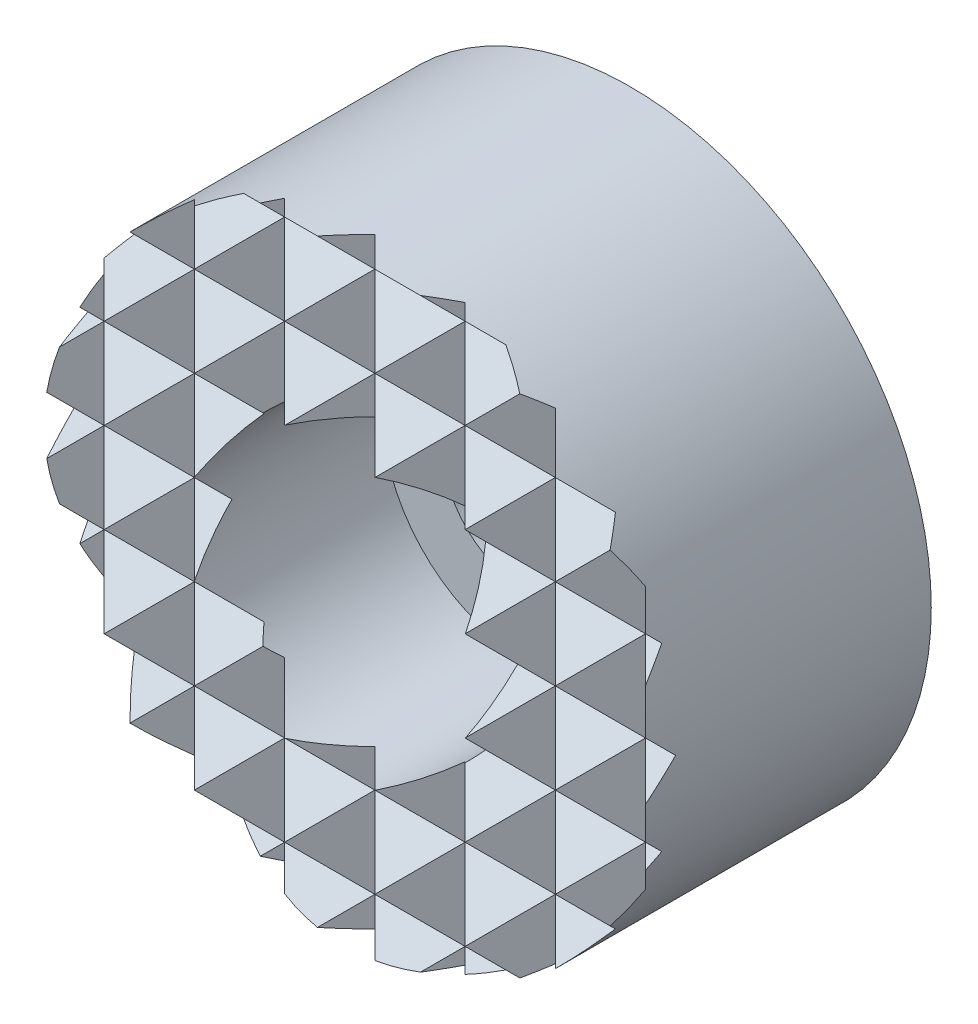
ISO-10303-21;
HEADER;
FILE_DESCRIPTION(('STEP AP214'),'2;1');
FILE_NAME('part.step','',(''),(''),'','','');
FILE_SCHEMA(('AUTOMOTIVE_DESIGN { 1 0 10303 214 1 1 1 1 }'));
ENDSEC;
DATA;
#1=APPLICATION_CONTEXT('core data for automotive mechanical design processes');
#2=APPLICATION_PROTOCOL_DEFINITION('international standard','automotive_design',2000,#1);
#3=PRODUCT_CONTEXT('',#1,'mechanical');
#4=PRODUCT('Part','Part','',(#3));
#5=PRODUCT_RELATED_PRODUCT_CATEGORY('part','',(#4));
#6=PRODUCT_DEFINITION_FORMATION('','',#4);
#7=PRODUCT_DEFINITION_CONTEXT('part definition',#1,'design');
#8=PRODUCT_DEFINITION('design','',#6,#7);
#9=PRODUCT_DEFINITION_SHAPE('','',#8);
#10=(LENGTH_UNIT() NAMED_UNIT(*) SI_UNIT(.MILLI.,.METRE.));
#11=(NAMED_UNIT(*) PLANE_ANGLE_UNIT() SI_UNIT($,.RADIAN.));
#12=(NAMED_UNIT(*) SI_UNIT($,.STERADIAN.) SOLID_ANGLE_UNIT());
#13=UNCERTAINTY_MEASURE_WITH_UNIT(LENGTH_MEASURE(1.E-05),#10,'distance_accuracy_value','');
#14=(GEOMETRIC_REPRESENTATION_CONTEXT(3) GLOBAL_UNCERTAINTY_ASSIGNED_CONTEXT((#13)) GLOBAL_UNIT_ASSIGNED_CONTEXT((#10,
#11,#12)) REPRESENTATION_CONTEXT('',''));
#15=CARTESIAN_POINT('',(0.,0.,0.));
#16=DIRECTION('',(0.,0.,1.));
#17=DIRECTION('',(1.,0.,0.));
#18=AXIS2_PLACEMENT_3D('',#15,#16,#17);
#19=CARTESIAN_POINT('',(6.,-15.,8.5));
#20=DIRECTION('',(0.707106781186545,0.,-0.70710678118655));
#21=DIRECTION('',(-0.70710678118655,0.,-0.707106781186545));
#22=AXIS2_PLACEMENT_3D('',#19,#20,#21);
#23=PLANE('',#22);
#24=CARTESIAN_POINT('',(0.,0.,2.50000000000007));
#25=DIRECTION('',(0.707106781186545,0.,-0.70710678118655));
#26=DIRECTION('',(-0.70710678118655,0.,-0.707106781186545));
#27=AXIS2_PLACEMENT_3D('',#24,#25,#26);
#28=ELLIPSE('',#27,14.1421356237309,10.);
#29=CARTESIAN_POINT('',(7.07106781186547,-7.07106781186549,9.57106781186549));
#30=VERTEX_POINT('',#29);
#31=CARTESIAN_POINT('',(6.,-8.,8.5));
#32=VERTEX_POINT('',#31);
#33=EDGE_CURVE('E640',#30,#32,#28,.T.);
#34=ORIENTED_EDGE('',*,*,#33,.F.);
#35=DIRECTION('',(-0.577350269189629,0.577350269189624,-0.577350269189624));
#36=VECTOR('',#35,1.);
#37=CARTESIAN_POINT('',(9.,-9.,11.5));
#38=LINE('',#37,#36);
#39=CARTESIAN_POINT('',(6.,-6.,8.5));
#40=VERTEX_POINT('',#39);
#41=EDGE_CURVE('E887',#30,#40,#38,.T.);
#42=ORIENTED_EDGE('',*,*,#41,.T.);
#43=DIRECTION('',(0.,1.,0.));
#44=VECTOR('',#43,1.);
#45=CARTESIAN_POINT('',(6.,-15.,8.5));
#46=LINE('',#45,#44);
#47=EDGE_CURVE('E537',#32,#40,#46,.T.);
#48=ORIENTED_EDGE('',*,*,#47,.F.);
#49=EDGE_LOOP('',(#34,#42,#48));
#50=FACE_BOUND('',#49,.T.);
#51=ADVANCED_FACE('F14',(#50),#23,.F.);
#52=CARTESIAN_POINT('',(6.,-3.,8.5));
#53=VERTEX_POINT('',#52);
#54=CARTESIAN_POINT('',(6.,0.,8.5));
#55=VERTEX_POINT('',#54);
#56=EDGE_CURVE('E1324',#53,#55,#46,.T.);
#57=ORIENTED_EDGE('',*,*,#56,.F.);
#58=DIRECTION('',(0.577350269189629,0.577350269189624,0.577350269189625));
#59=VECTOR('',#58,1.);
#60=CARTESIAN_POINT('',(1.99999999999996,-7.,4.5));
#61=LINE('',#60,#59);
#62=CARTESIAN_POINT('',(7.5,-1.5,10.));
#63=VERTEX_POINT('',#62);
#64=EDGE_CURVE('E986',#53,#63,#61,.T.);
#65=ORIENTED_EDGE('',*,*,#64,.T.);
#66=DIRECTION('',(-0.577350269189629,0.577350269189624,-0.577350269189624));
#67=VECTOR('',#66,1.);
#68=CARTESIAN_POINT('',(11.,-5.,13.5));
#69=LINE('',#68,#67);
#70=EDGE_CURVE('E1011',#63,#55,#69,.T.);
#71=ORIENTED_EDGE('',*,*,#70,.T.);
#72=EDGE_LOOP('',(#57,#65,#71));
#73=FACE_BOUND('',#72,.T.);
#74=ADVANCED_FACE('F1286',(#73),#23,.F.);
#75=CARTESIAN_POINT('',(6.,6.,8.5));
#76=VERTEX_POINT('',#75);
#77=CARTESIAN_POINT('',(6.,8.,8.5));
#78=VERTEX_POINT('',#77);
#79=EDGE_CURVE('E540',#76,#78,#46,.T.);
#80=ORIENTED_EDGE('',*,*,#79,.F.);
#81=DIRECTION('',(0.577350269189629,0.577350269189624,0.577350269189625));
#82=VECTOR('',#81,1.);
#83=CARTESIAN_POINT('',(-1.00000000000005,-0.999999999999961,1.50000000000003));
#84=LINE('',#83,#82);
#85=CARTESIAN_POINT('',(7.07106781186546,7.07106781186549,9.57106781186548));
#86=VERTEX_POINT('',#85);
#87=EDGE_CURVE('E1194',#76,#86,#84,.T.);
#88=ORIENTED_EDGE('',*,*,#87,.T.);
#89=EDGE_CURVE('E636',#78,#86,#28,.T.);
#90=ORIENTED_EDGE('',*,*,#89,.F.);
#91=EDGE_LOOP('',(#80,#88,#90));
#92=FACE_BOUND('',#91,.T.);
#93=ADVANCED_FACE('F1221',(#92),#23,.F.);
#94=CARTESIAN_POINT('',(6.,3.,8.5));
#95=VERTEX_POINT('',#94);
#96=EDGE_CURVE('E1321',#55,#95,#46,.T.);
#97=ORIENTED_EDGE('',*,*,#96,.F.);
#98=DIRECTION('',(0.577350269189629,0.577350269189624,0.577350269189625));
#99=VECTOR('',#98,1.);
#100=CARTESIAN_POINT('',(0.999999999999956,-5.,3.5));
#101=LINE('',#100,#99);
#102=CARTESIAN_POINT('',(7.5,1.5,10.));
#103=VERTEX_POINT('',#102);
#104=EDGE_CURVE('E1034',#55,#103,#101,.T.);
#105=ORIENTED_EDGE('',*,*,#104,.T.);
#106=DIRECTION('',(-0.577350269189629,0.577350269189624,-0.577350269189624));
#107=VECTOR('',#106,1.);
#108=CARTESIAN_POINT('',(12.,-2.99999999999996,14.5));
#109=LINE('',#108,#107);
#110=EDGE_CURVE('E499',#103,#95,#109,.T.);
#111=ORIENTED_EDGE('',*,*,#110,.T.);
#112=EDGE_LOOP('',(#97,#105,#111));
#113=FACE_BOUND('',#112,.T.);
#114=ADVANCED_FACE('F1303',(#113),#23,.F.);
#115=CARTESIAN_POINT('',(7.5,-15.,10.));
#116=DIRECTION('',(-0.70710678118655,0.,-0.707106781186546));
#117=DIRECTION('',(-0.707106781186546,0.,0.70710678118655));
#118=AXIS2_PLACEMENT_3D('',#115,#116,#117);
#119=PLANE('',#118);
#120=DIRECTION('',(-0.577350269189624,-0.577350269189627,0.577350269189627));
#121=VECTOR('',#120,1.);
#122=CARTESIAN_POINT('',(4.,-8.,13.5));
#123=LINE('',#122,#121);
#124=CARTESIAN_POINT('',(9.,-3.,8.5));
#125=VERTEX_POINT('',#124);
#126=CARTESIAN_POINT('',(7.5,-4.5,10.));
#127=VERTEX_POINT('',#126);
#128=EDGE_CURVE('E960',#125,#127,#123,.T.);
#129=ORIENTED_EDGE('',*,*,#128,.T.);
#130=DIRECTION('',(0.577350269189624,-0.577350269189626,-0.577350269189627));
#131=VECTOR('',#130,1.);
#132=CARTESIAN_POINT('',(11.,-8.,6.5));
#133=LINE('',#132,#131);
#134=CARTESIAN_POINT('',(8.41013748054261,-5.41013748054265,9.08986251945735));
#135=VERTEX_POINT('',#134);
#136=EDGE_CURVE('E928',#127,#135,#133,.T.);
#137=ORIENTED_EDGE('',*,*,#136,.T.);
#138=CARTESIAN_POINT('',(0.,0.,17.5));
#139=DIRECTION('',(-0.70710678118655,0.,-0.707106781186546));
#140=DIRECTION('',(0.707106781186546,0.,-0.70710678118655));
#141=AXIS2_PLACEMENT_3D('',#138,#139,#140);
#142=ELLIPSE('',#141,14.142135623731,10.);
#143=CARTESIAN_POINT('',(9.,-4.35889894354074,8.5));
#144=VERTEX_POINT('',#143);
#145=EDGE_CURVE('E643',#144,#135,#142,.T.);
#146=ORIENTED_EDGE('',*,*,#145,.F.);
#147=DIRECTION('',(0.,1.,0.));
#148=VECTOR('',#147,1.);
#149=CARTESIAN_POINT('',(9.,-15.,8.5));
#150=LINE('',#149,#148);
#151=EDGE_CURVE('E541',#144,#125,#150,.T.);
#152=ORIENTED_EDGE('',*,*,#151,.T.);
#153=EDGE_LOOP('',(#129,#137,#146,#152));
#154=FACE_BOUND('',#153,.T.);
#155=ADVANCED_FACE('F1312',(#154),#119,.F.);
#156=DIRECTION('',(-0.577350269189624,-0.577350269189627,0.577350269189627));
#157=VECTOR('',#156,1.);
#158=CARTESIAN_POINT('',(3.,-6.,14.5));
#159=LINE('',#158,#157);
#160=CARTESIAN_POINT('',(9.,0.,8.5));
#161=VERTEX_POINT('',#160);
#162=EDGE_CURVE('E1014',#161,#63,#159,.T.);
#163=ORIENTED_EDGE('',*,*,#162,.T.);
#164=DIRECTION('',(0.577350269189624,-0.577350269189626,-0.577350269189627));
#165=VECTOR('',#164,1.);
#166=CARTESIAN_POINT('',(12.,-6.,5.5));
#167=LINE('',#166,#165);
#168=EDGE_CURVE('E29',#63,#125,#167,.T.);
#169=ORIENTED_EDGE('',*,*,#168,.T.);
#170=EDGE_CURVE('E544',#125,#161,#150,.T.);
#171=ORIENTED_EDGE('',*,*,#170,.T.);
#172=EDGE_LOOP('',(#163,#169,#171));
#173=FACE_BOUND('',#172,.T.);
#174=ADVANCED_FACE('F1318',(#173),#119,.F.);
#175=DIRECTION('',(-0.577350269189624,-0.577350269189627,0.577350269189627));
#176=VECTOR('',#175,1.);
#177=CARTESIAN_POINT('',(2.,-4.,15.5));
#178=LINE('',#177,#176);
#179=CARTESIAN_POINT('',(9.,3.,8.5));
#180=VERTEX_POINT('',#179);
#181=EDGE_CURVE('E514',#180,#103,#178,.T.);
#182=ORIENTED_EDGE('',*,*,#181,.T.);
#183=DIRECTION('',(0.577350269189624,-0.577350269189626,-0.577350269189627));
#184=VECTOR('',#183,1.);
#185=CARTESIAN_POINT('',(13.,-4.,4.5));
#186=LINE('',#185,#184);
#187=EDGE_CURVE('E1037',#103,#161,#186,.T.);
#188=ORIENTED_EDGE('',*,*,#187,.T.);
#189=EDGE_CURVE('E1368',#161,#180,#150,.T.);
#190=ORIENTED_EDGE('',*,*,#189,.T.);
#191=EDGE_LOOP('',(#182,#188,#190));
#192=FACE_BOUND('',#191,.T.);
#193=ADVANCED_FACE('F2395',(#192),#119,.F.);
#194=CARTESIAN_POINT('',(9.,-15.,8.5));
#195=DIRECTION('',(0.707106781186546,0.,-0.70710678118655));
#196=DIRECTION('',(-0.70710678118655,0.,-0.707106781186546));
#197=AXIS2_PLACEMENT_3D('',#194,#195,#196);
#198=PLANE('',#197);
#199=ORIENTED_EDGE('',*,*,#189,.F.);
#200=DIRECTION('',(0.577350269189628,0.577350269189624,0.577350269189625));
#201=VECTOR('',#200,1.);
#202=CARTESIAN_POINT('',(4.,-5.,3.5));
#203=LINE('',#202,#201);
#204=CARTESIAN_POINT('',(9.95435605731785,0.954356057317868,9.45435605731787));
#205=VERTEX_POINT('',#204);
#206=EDGE_CURVE('E1040',#161,#205,#203,.T.);
#207=ORIENTED_EDGE('',*,*,#206,.T.);
#208=CARTESIAN_POINT('',(0.,0.,-0.499999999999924));
#209=DIRECTION('',(0.707106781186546,0.,-0.70710678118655));
#210=DIRECTION('',(-0.70710678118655,0.,-0.707106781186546));
#211=AXIS2_PLACEMENT_3D('',#208,#209,#210);
#212=ELLIPSE('',#211,14.1421356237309,10.);
#213=CARTESIAN_POINT('',(9.74165738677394,2.25834261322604,9.24165738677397));
#214=VERTEX_POINT('',#213);
#215=EDGE_CURVE('E647',#214,#205,#212,.T.);
#216=ORIENTED_EDGE('',*,*,#215,.F.);
#217=DIRECTION('',(-0.577350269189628,0.577350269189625,-0.577350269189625));
#218=VECTOR('',#217,1.);
#219=CARTESIAN_POINT('',(15.,-3.,14.5));
#220=LINE('',#219,#218);
#221=EDGE_CURVE('E506',#214,#180,#220,.T.);
#222=ORIENTED_EDGE('',*,*,#221,.T.);
#223=EDGE_LOOP('',(#199,#207,#216,#222));
#224=FACE_BOUND('',#223,.T.);
#225=ADVANCED_FACE('F2387',(#224),#198,.F.);
#226=CARTESIAN_POINT('',(9.95435605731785,-0.954356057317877,9.45435605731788));
#227=VERTEX_POINT('',#226);
#228=CARTESIAN_POINT('',(9.74165738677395,-2.25834261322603,9.24165738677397));
#229=VERTEX_POINT('',#228);
#230=EDGE_CURVE('E2837',#227,#229,#212,.T.);
#231=ORIENTED_EDGE('',*,*,#230,.F.);
#232=DIRECTION('',(-0.577350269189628,0.577350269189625,-0.577350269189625));
#233=VECTOR('',#232,1.);
#234=CARTESIAN_POINT('',(14.,-5.,13.5));
#235=LINE('',#234,#233);
#236=EDGE_CURVE('E1017',#227,#161,#235,.T.);
#237=ORIENTED_EDGE('',*,*,#236,.T.);
#238=ORIENTED_EDGE('',*,*,#170,.F.);
#239=DIRECTION('',(0.577350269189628,0.577350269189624,0.577350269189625));
#240=VECTOR('',#239,1.);
#241=CARTESIAN_POINT('',(5.,-7.,4.5));
#242=LINE('',#241,#240);
#243=EDGE_CURVE('E990',#125,#229,#242,.T.);
#244=ORIENTED_EDGE('',*,*,#243,.T.);
#245=EDGE_LOOP('',(#231,#237,#238,#244));
#246=FACE_BOUND('',#245,.T.);
#247=ADVANCED_FACE('F1365',(#246),#198,.F.);
#248=CARTESIAN_POINT('',(9.40312423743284,-3.40312423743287,8.90312423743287));
#249=VERTEX_POINT('',#248);
#250=EDGE_CURVE('E642',#249,#144,#212,.T.);
#251=ORIENTED_EDGE('',*,*,#250,.F.);
#252=DIRECTION('',(-0.577350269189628,0.577350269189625,-0.577350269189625));
#253=VECTOR('',#252,1.);
#254=CARTESIAN_POINT('',(13.,-7.,12.5));
#255=LINE('',#254,#253);
#256=EDGE_CURVE('E963',#249,#125,#255,.T.);
#257=ORIENTED_EDGE('',*,*,#256,.T.);
#258=ORIENTED_EDGE('',*,*,#151,.F.);
#259=EDGE_LOOP('',(#251,#257,#258));
#260=FACE_BOUND('',#259,.T.);
#261=ADVANCED_FACE('F1357',(#260),#198,.F.);
#262=CARTESIAN_POINT('',(-10.5,-15.,10.));
#263=DIRECTION('',(-0.70710678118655,0.,-0.707106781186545));
#264=DIRECTION('',(-0.707106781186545,0.,0.70710678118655));
#265=AXIS2_PLACEMENT_3D('',#262,#263,#264);
#266=PLANE('',#265);
#267=CARTESIAN_POINT('',(0.,0.,-0.500000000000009));
#268=DIRECTION('',(-0.70710678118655,0.,-0.707106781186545));
#269=DIRECTION('',(0.707106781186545,0.,-0.70710678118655));
#270=AXIS2_PLACEMENT_3D('',#267,#268,#269);
#271=ELLIPSE('',#270,14.142135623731,10.);
#272=CARTESIAN_POINT('',(-9.95435605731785,0.954356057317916,9.45435605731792));
#273=VERTEX_POINT('',#272);
#274=CARTESIAN_POINT('',(-9.74165738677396,2.25834261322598,9.24165738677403));
#275=VERTEX_POINT('',#274);
#276=EDGE_CURVE('E493',#273,#275,#271,.T.);
#277=ORIENTED_EDGE('',*,*,#276,.F.);
#278=DIRECTION('',(0.577350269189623,-0.577350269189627,-0.577350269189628));
#279=VECTOR('',#278,1.);
#280=CARTESIAN_POINT('',(-5.,-4.,4.5));
#281=LINE('',#280,#279);
#282=CARTESIAN_POINT('',(-9.,0.,8.5));
#283=VERTEX_POINT('',#282);
#284=EDGE_CURVE('E1021',#273,#283,#281,.T.);
#285=ORIENTED_EDGE('',*,*,#284,.T.);
#286=DIRECTION('',(0.,1.,0.));
#287=VECTOR('',#286,1.);
#288=CARTESIAN_POINT('',(-9.,-15.,8.5));
#289=LINE('',#288,#287);
#290=CARTESIAN_POINT('',(-9.,3.,8.5));
#291=VERTEX_POINT('',#290);
#292=EDGE_CURVE('E1051',#283,#291,#289,.T.);
#293=ORIENTED_EDGE('',*,*,#292,.T.);
#294=DIRECTION('',(-0.577350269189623,-0.577350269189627,0.577350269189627));
#295=VECTOR('',#294,1.);
#296=CARTESIAN_POINT('',(-16.,-4.00000000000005,15.5));
#297=LINE('',#296,#295);
#298=EDGE_CURVE('E482',#291,#275,#297,.T.);
#299=ORIENTED_EDGE('',*,*,#298,.T.);
#300=EDGE_LOOP('',(#277,#285,#293,#299));
#301=FACE_BOUND('',#300,.T.);
#302=ADVANCED_FACE('F1049',(#301),#266,.F.);
#303=CARTESIAN_POINT('',(-9.,-3.,8.5));
#304=VERTEX_POINT('',#303);
#305=EDGE_CURVE('E549',#304,#283,#289,.T.);
#306=ORIENTED_EDGE('',*,*,#305,.T.);
#307=DIRECTION('',(-0.577350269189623,-0.577350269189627,0.577350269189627));
#308=VECTOR('',#307,1.);
#309=CARTESIAN_POINT('',(-15.,-6.,14.5));
#310=LINE('',#309,#308);
#311=CARTESIAN_POINT('',(-9.95435605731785,-0.954356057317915,9.45435605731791));
#312=VERTEX_POINT('',#311);
#313=EDGE_CURVE('E999',#283,#312,#310,.T.);
#314=ORIENTED_EDGE('',*,*,#313,.T.);
#315=CARTESIAN_POINT('',(-9.74165738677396,-2.25834261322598,9.24165738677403));
#316=VERTEX_POINT('',#315);
#317=EDGE_CURVE('E635',#316,#312,#271,.T.);
#318=ORIENTED_EDGE('',*,*,#317,.F.);
#319=DIRECTION('',(0.577350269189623,-0.577350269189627,-0.577350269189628));
#320=VECTOR('',#319,1.);
#321=CARTESIAN_POINT('',(-6.,-6.,5.5));
#322=LINE('',#321,#320);
#323=EDGE_CURVE('E972',#316,#304,#322,.T.);
#324=ORIENTED_EDGE('',*,*,#323,.T.);
#325=EDGE_LOOP('',(#306,#314,#318,#324));
#326=FACE_BOUND('',#325,.T.);
#327=ADVANCED_FACE('F1071',(#326),#266,.F.);
#328=CARTESIAN_POINT('',(-9.,-4.35889894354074,8.5));
#329=VERTEX_POINT('',#328);
#330=EDGE_CURVE('E546',#329,#304,#289,.T.);
#331=ORIENTED_EDGE('',*,*,#330,.T.);
#332=DIRECTION('',(-0.577350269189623,-0.577350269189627,0.577350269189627));
#333=VECTOR('',#332,1.);
#334=CARTESIAN_POINT('',(-14.,-8.,13.5));
#335=LINE('',#334,#333);
#336=CARTESIAN_POINT('',(-9.40312423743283,-3.4031242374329,8.9031242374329));
#337=VERTEX_POINT('',#336);
#338=EDGE_CURVE('E940',#304,#337,#335,.T.);
#339=ORIENTED_EDGE('',*,*,#338,.T.);
#340=EDGE_CURVE('E632',#329,#337,#271,.T.);
#341=ORIENTED_EDGE('',*,*,#340,.F.);
#342=EDGE_LOOP('',(#331,#339,#341));
#343=FACE_BOUND('',#342,.T.);
#344=ADVANCED_FACE('F2378',(#343),#266,.F.);
#345=CARTESIAN_POINT('',(-9.,-15.,8.5));
#346=DIRECTION('',(0.707106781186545,0.,-0.70710678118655));
#347=DIRECTION('',(-0.70710678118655,0.,-0.707106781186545));
#348=AXIS2_PLACEMENT_3D('',#345,#346,#347);
#349=PLANE('',#348);
#350=CARTESIAN_POINT('',(0.,0.,17.5));
#351=DIRECTION('',(0.707106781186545,0.,-0.70710678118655));
#352=DIRECTION('',(-0.70710678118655,0.,-0.707106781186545));
#353=AXIS2_PLACEMENT_3D('',#350,#351,#352);
#354=ELLIPSE('',#353,14.1421356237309,10.);
#355=CARTESIAN_POINT('',(-8.41013748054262,-5.41013748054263,9.08986251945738));
#356=VERTEX_POINT('',#355);
#357=EDGE_CURVE('E631',#356,#329,#354,.T.);
#358=ORIENTED_EDGE('',*,*,#357,.F.);
#359=DIRECTION('',(0.577350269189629,0.577350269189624,0.577350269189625));
#360=VECTOR('',#359,1.);
#361=CARTESIAN_POINT('',(-12.,-9.,5.5));
#362=LINE('',#361,#360);
#363=CARTESIAN_POINT('',(-7.5,-4.5,10.));
#364=VERTEX_POINT('',#363);
#365=EDGE_CURVE('E899',#356,#364,#362,.T.);
#366=ORIENTED_EDGE('',*,*,#365,.T.);
#367=DIRECTION('',(-0.577350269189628,0.577350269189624,-0.577350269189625));
#368=VECTOR('',#367,1.);
#369=CARTESIAN_POINT('',(-5.,-7.,12.5));
#370=LINE('',#369,#368);
#371=EDGE_CURVE('E937',#364,#304,#370,.T.);
#372=ORIENTED_EDGE('',*,*,#371,.T.);
#373=ORIENTED_EDGE('',*,*,#330,.F.);
#374=EDGE_LOOP('',(#358,#366,#372,#373));
#375=FACE_BOUND('',#374,.T.);
#376=ADVANCED_FACE('F1280',(#375),#349,.F.);
#377=ORIENTED_EDGE('',*,*,#305,.F.);
#378=DIRECTION('',(0.577350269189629,0.577350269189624,0.577350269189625));
#379=VECTOR('',#378,1.);
#380=CARTESIAN_POINT('',(-13.,-7.,4.5));
#381=LINE('',#380,#379);
#382=CARTESIAN_POINT('',(-7.5,-1.5,10.));
#383=VERTEX_POINT('',#382);
#384=EDGE_CURVE('E969',#304,#383,#381,.T.);
#385=ORIENTED_EDGE('',*,*,#384,.T.);
#386=DIRECTION('',(-0.577350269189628,0.577350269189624,-0.577350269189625));
#387=VECTOR('',#386,1.);
#388=CARTESIAN_POINT('',(-4.,-5.,13.5));
#389=LINE('',#388,#387);
#390=EDGE_CURVE('E996',#383,#283,#389,.T.);
#391=ORIENTED_EDGE('',*,*,#390,.T.);
#392=EDGE_LOOP('',(#377,#385,#391));
#393=FACE_BOUND('',#392,.T.);
#394=ADVANCED_FACE('F1268',(#393),#349,.F.);
#395=ORIENTED_EDGE('',*,*,#292,.F.);
#396=DIRECTION('',(0.577350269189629,0.577350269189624,0.577350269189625));
#397=VECTOR('',#396,1.);
#398=CARTESIAN_POINT('',(-14.,-5.,3.50000000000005));
#399=LINE('',#398,#397);
#400=CARTESIAN_POINT('',(-7.5,1.5,10.));
#401=VERTEX_POINT('',#400);
#402=EDGE_CURVE('E707',#283,#401,#399,.T.);
#403=ORIENTED_EDGE('',*,*,#402,.T.);
#404=DIRECTION('',(-0.577350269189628,0.577350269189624,-0.577350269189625));
#405=VECTOR('',#404,1.);
#406=CARTESIAN_POINT('',(-3.,-3.,14.5));
#407=LINE('',#406,#405);
#408=EDGE_CURVE('E1044',#401,#291,#407,.T.);
#409=ORIENTED_EDGE('',*,*,#408,.T.);
#410=EDGE_LOOP('',(#395,#403,#409));
#411=FACE_BOUND('',#410,.T.);
#412=ADVANCED_FACE('F1265',(#411),#349,.F.);
#413=CARTESIAN_POINT('',(-7.5,-15.,10.));
#414=DIRECTION('',(-0.70710678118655,0.,-0.707106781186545));
#415=DIRECTION('',(-0.707106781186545,0.,0.70710678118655));
#416=AXIS2_PLACEMENT_3D('',#413,#414,#415);
#417=PLANE('',#416);
#418=DIRECTION('',(0.,1.,0.));
#419=VECTOR('',#418,1.);
#420=CARTESIAN_POINT('',(-6.,-15.,8.5));
#421=LINE('',#420,#419);
#422=CARTESIAN_POINT('',(-6.,-8.,8.5));
#423=VERTEX_POINT('',#422);
#424=CARTESIAN_POINT('',(-6.,-6.,8.5));
#425=VERTEX_POINT('',#424);
#426=EDGE_CURVE('E551',#423,#425,#421,.T.);
#427=ORIENTED_EDGE('',*,*,#426,.T.);
#428=DIRECTION('',(-0.577350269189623,-0.577350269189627,0.577350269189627));
#429=VECTOR('',#428,1.);
#430=CARTESIAN_POINT('',(-10.,-10.,12.5));
#431=LINE('',#430,#429);
#432=CARTESIAN_POINT('',(-7.07106781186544,-7.07106781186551,9.5710678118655));
#433=VERTEX_POINT('',#432);
#434=EDGE_CURVE('E867',#425,#433,#431,.T.);
#435=ORIENTED_EDGE('',*,*,#434,.T.);
#436=CARTESIAN_POINT('',(0.,0.,2.5));
#437=DIRECTION('',(-0.70710678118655,0.,-0.707106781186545));
#438=DIRECTION('',(0.707106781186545,0.,-0.70710678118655));
#439=AXIS2_PLACEMENT_3D('',#436,#437,#438);
#440=ELLIPSE('',#439,14.142135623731,10.);
#441=EDGE_CURVE('E627',#423,#433,#440,.T.);
#442=ORIENTED_EDGE('',*,*,#441,.F.);
#443=EDGE_LOOP('',(#427,#435,#442));
#444=FACE_BOUND('',#443,.T.);
#445=ADVANCED_FACE('F1267',(#444),#417,.F.);
#446=DIRECTION('',(-0.577350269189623,-0.577350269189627,0.577350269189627));
#447=VECTOR('',#446,1.);
#448=CARTESIAN_POINT('',(-12.,-6.,14.5));
#449=LINE('',#448,#447);
#450=CARTESIAN_POINT('',(-6.,0.,8.5));
#451=VERTEX_POINT('',#450);
#452=EDGE_CURVE('E993',#451,#383,#449,.T.);
#453=ORIENTED_EDGE('',*,*,#452,.T.);
#454=DIRECTION('',(0.577350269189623,-0.577350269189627,-0.577350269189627));
#455=VECTOR('',#454,1.);
#456=CARTESIAN_POINT('',(-2.99999999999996,-6.,5.5));
#457=LINE('',#456,#455);
#458=CARTESIAN_POINT('',(-6.,-3.,8.5));
#459=VERTEX_POINT('',#458);
#460=EDGE_CURVE('E966',#383,#459,#457,.T.);
#461=ORIENTED_EDGE('',*,*,#460,.T.);
#462=EDGE_CURVE('E688',#459,#451,#421,.T.);
#463=ORIENTED_EDGE('',*,*,#462,.T.);
#464=EDGE_LOOP('',(#453,#461,#463));
#465=FACE_BOUND('',#464,.T.);
#466=ADVANCED_FACE('F1275',(#465),#417,.F.);
#467=CARTESIAN_POINT('',(-7.07106781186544,7.07106781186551,9.5710678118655));
#468=VERTEX_POINT('',#467);
#469=CARTESIAN_POINT('',(-6.,8.,8.5));
#470=VERTEX_POINT('',#469);
#471=EDGE_CURVE('E624',#468,#470,#440,.T.);
#472=ORIENTED_EDGE('',*,*,#471,.F.);
#473=DIRECTION('',(0.577350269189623,-0.577350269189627,-0.577350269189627));
#474=VECTOR('',#473,1.);
#475=CARTESIAN_POINT('',(0.,0.,2.5));
#476=LINE('',#475,#474);
#477=CARTESIAN_POINT('',(-6.,6.,8.5));
#478=VERTEX_POINT('',#477);
#479=EDGE_CURVE('E1174',#468,#478,#476,.T.);
#480=ORIENTED_EDGE('',*,*,#479,.T.);
#481=EDGE_CURVE('E554',#478,#470,#421,.T.);
#482=ORIENTED_EDGE('',*,*,#481,.T.);
#483=EDGE_LOOP('',(#472,#480,#482));
#484=FACE_BOUND('',#483,.T.);
#485=ADVANCED_FACE('F1528',(#484),#417,.F.);
#486=DIRECTION('',(-0.577350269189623,-0.577350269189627,0.577350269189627));
#487=VECTOR('',#486,1.);
#488=CARTESIAN_POINT('',(-13.,-4.,15.5));
#489=LINE('',#488,#487);
#490=CARTESIAN_POINT('',(-6.,3.,8.5));
#491=VERTEX_POINT('',#490);
#492=EDGE_CURVE('E702',#491,#401,#489,.T.);
#493=ORIENTED_EDGE('',*,*,#492,.T.);
#494=DIRECTION('',(0.577350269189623,-0.577350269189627,-0.577350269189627));
#495=VECTOR('',#494,1.);
#496=CARTESIAN_POINT('',(-1.99999999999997,-4.,4.5));
#497=LINE('',#496,#495);
#498=EDGE_CURVE('E696',#401,#451,#497,.T.);
#499=ORIENTED_EDGE('',*,*,#498,.T.);
#500=EDGE_CURVE('E699',#451,#491,#421,.T.);
#501=ORIENTED_EDGE('',*,*,#500,.T.);
#502=EDGE_LOOP('',(#493,#499,#501));
#503=FACE_BOUND('',#502,.T.);
#504=ADVANCED_FACE('F698',(#503),#417,.F.);
#505=CARTESIAN_POINT('',(-3.,-15.,8.5));
#506=DIRECTION('',(0.707106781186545,0.,-0.707106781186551));
#507=DIRECTION('',(-0.707106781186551,0.,-0.707106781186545));
#508=AXIS2_PLACEMENT_3D('',#505,#506,#507);
#509=PLANE('',#508);
#510=DIRECTION('',(0.,1.,0.));
#511=VECTOR('',#510,1.);
#512=CARTESIAN_POINT('',(-3.,-15.,8.5));
#513=LINE('',#512,#511);
#514=CARTESIAN_POINT('',(-3.,9.,8.5));
#515=VERTEX_POINT('',#514);
#516=CARTESIAN_POINT('',(-3.,9.53939201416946,8.5));
#517=VERTEX_POINT('',#516);
#518=EDGE_CURVE('E505',#515,#517,#513,.T.);
#519=ORIENTED_EDGE('',*,*,#518,.F.);
#520=DIRECTION('',(0.577350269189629,0.577350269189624,0.577350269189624));
#521=VECTOR('',#520,1.);
#522=CARTESIAN_POINT('',(-11.,1.00000000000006,0.500000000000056));
#523=LINE('',#522,#521);
#524=CARTESIAN_POINT('',(-2.25834261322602,9.74165738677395,9.24165738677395));
#525=VERTEX_POINT('',#524);
#526=EDGE_CURVE('E771',#515,#525,#523,.T.);
#527=ORIENTED_EDGE('',*,*,#526,.T.);
#528=CARTESIAN_POINT('',(0.,0.,11.5));
#529=DIRECTION('',(0.707106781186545,0.,-0.707106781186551));
#530=DIRECTION('',(-0.707106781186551,0.,-0.707106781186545));
#531=AXIS2_PLACEMENT_3D('',#528,#529,#530);
#532=ELLIPSE('',#531,14.1421356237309,10.);
#533=EDGE_CURVE('E582',#517,#525,#532,.T.);
#534=ORIENTED_EDGE('',*,*,#533,.F.);
#535=EDGE_LOOP('',(#519,#527,#534));
#536=FACE_BOUND('',#535,.T.);
#537=ADVANCED_FACE('F785',(#536),#509,.F.);
#538=CARTESIAN_POINT('',(-2.99999999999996,-6.,8.5));
#539=VERTEX_POINT('',#538);
#540=CARTESIAN_POINT('',(-3.,-3.68272996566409,8.5));
#541=VERTEX_POINT('',#540);
#542=EDGE_CURVE('E557',#539,#541,#513,.T.);
#543=ORIENTED_EDGE('',*,*,#542,.F.);
#544=DIRECTION('',(0.577350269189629,0.577350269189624,0.577350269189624));
#545=VECTOR('',#544,1.);
#546=CARTESIAN_POINT('',(-6.,-9.,5.5));
#547=LINE('',#546,#545);
#548=CARTESIAN_POINT('',(-1.5052038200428,-4.50520382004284,9.99479617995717));
#549=VERTEX_POINT('',#548);
#550=EDGE_CURVE('E893',#539,#549,#547,.T.);
#551=ORIENTED_EDGE('',*,*,#550,.T.);
#552=CARTESIAN_POINT('',(0.,0.,11.5));
#553=DIRECTION('',(0.707106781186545,0.,-0.707106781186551));
#554=DIRECTION('',(0.707106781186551,0.,0.707106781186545));
#555=AXIS2_PLACEMENT_3D('',#552,#553,#554);
#556=ELLIPSE('',#555,6.71751442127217,4.75);
#557=EDGE_CURVE('E605',#541,#549,#556,.F.);
#558=ORIENTED_EDGE('',*,*,#557,.F.);
#559=EDGE_LOOP('',(#543,#551,#558));
#560=FACE_BOUND('',#559,.T.);
#561=ADVANCED_FACE('F1584',(#560),#509,.F.);
#562=CARTESIAN_POINT('',(-1.49999999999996,-15.,10.));
#563=DIRECTION('',(-0.70710678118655,0.,-0.707106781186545));
#564=DIRECTION('',(-0.707106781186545,0.,0.70710678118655));
#565=AXIS2_PLACEMENT_3D('',#562,#563,#564);
#566=PLANE('',#565);
#567=CARTESIAN_POINT('',(0.,0.,8.5));
#568=DIRECTION('',(-0.70710678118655,0.,-0.707106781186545));
#569=DIRECTION('',(-0.707106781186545,0.,0.70710678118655));
#570=AXIS2_PLACEMENT_3D('',#567,#568,#569);
#571=ELLIPSE('',#570,6.71751442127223,4.75);
#572=CARTESIAN_POINT('',(-1.48961925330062,-4.51038074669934,9.98961925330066));
#573=VERTEX_POINT('',#572);
#574=CARTESIAN_POINT('',(0.,-4.75,8.5));
#575=VERTEX_POINT('',#574);
#576=EDGE_CURVE('E609',#573,#575,#571,.F.);
#577=ORIENTED_EDGE('',*,*,#576,.F.);
#578=DIRECTION('',(0.577350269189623,-0.577350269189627,-0.577350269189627));
#579=VECTOR('',#578,1.);
#580=CARTESIAN_POINT('',(2.00000000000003,-8.,6.5));
#581=LINE('',#580,#579);
#582=CARTESIAN_POINT('',(0.,-6.,8.5));
#583=VERTEX_POINT('',#582);
#584=EDGE_CURVE('E909',#573,#583,#581,.T.);
#585=ORIENTED_EDGE('',*,*,#584,.T.);
#586=DIRECTION('',(0.,1.,0.));
#587=VECTOR('',#586,1.);
#588=CARTESIAN_POINT('',(0.,-15.,8.5));
#589=LINE('',#588,#587);
#590=EDGE_CURVE('E526',#583,#575,#589,.T.);
#591=ORIENTED_EDGE('',*,*,#590,.T.);
#592=EDGE_LOOP('',(#577,#585,#591));
#593=FACE_BOUND('',#592,.T.);
#594=ADVANCED_FACE('F1919',(#593),#566,.F.);
#595=CARTESIAN_POINT('',(0.,0.,8.5));
#596=DIRECTION('',(-0.70710678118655,0.,-0.707106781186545));
#597=DIRECTION('',(0.707106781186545,0.,-0.70710678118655));
#598=AXIS2_PLACEMENT_3D('',#595,#596,#597);
#599=ELLIPSE('',#598,14.142135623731,10.);
#600=CARTESIAN_POINT('',(-0.954356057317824,9.95435605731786,9.45435605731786));
#601=VERTEX_POINT('',#600);
#602=CARTESIAN_POINT('',(0.,10.,8.5));
#603=VERTEX_POINT('',#602);
#604=EDGE_CURVE('E577',#601,#603,#599,.T.);
#605=ORIENTED_EDGE('',*,*,#604,.F.);
#606=DIRECTION('',(0.577350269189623,-0.577350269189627,-0.577350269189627));
#607=VECTOR('',#606,1.);
#608=CARTESIAN_POINT('',(7.,2.,1.49999999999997));
#609=LINE('',#608,#607);
#610=CARTESIAN_POINT('',(0.,9.,8.5));
#611=VERTEX_POINT('',#610);
#612=EDGE_CURVE('E790',#601,#611,#609,.T.);
#613=ORIENTED_EDGE('',*,*,#612,.T.);
#614=EDGE_CURVE('E528',#611,#603,#589,.T.);
#615=ORIENTED_EDGE('',*,*,#614,.T.);
#616=EDGE_LOOP('',(#605,#613,#615));
#617=FACE_BOUND('',#616,.T.);
#618=ADVANCED_FACE('F1897',(#617),#566,.F.);
#619=CARTESIAN_POINT('',(0.,-15.,8.5));
#620=DIRECTION('',(0.707106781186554,0.,-0.707106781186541));
#621=DIRECTION('',(-0.707106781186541,0.,-0.707106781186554));
#622=AXIS2_PLACEMENT_3D('',#619,#620,#621);
#623=PLANE('',#622);
#624=ORIENTED_EDGE('',*,*,#614,.F.);
#625=DIRECTION('',(0.577350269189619,0.577350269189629,0.577350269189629));
#626=VECTOR('',#625,1.);
#627=CARTESIAN_POINT('',(-8.,0.999999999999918,0.499999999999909));
#628=LINE('',#627,#626);
#629=CARTESIAN_POINT('',(0.954356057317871,9.95435605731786,9.45435605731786));
#630=VERTEX_POINT('',#629);
#631=EDGE_CURVE('E794',#611,#630,#628,.T.);
#632=ORIENTED_EDGE('',*,*,#631,.T.);
#633=CARTESIAN_POINT('',(0.,0.,8.5));
#634=DIRECTION('',(0.707106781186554,0.,-0.707106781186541));
#635=DIRECTION('',(-0.707106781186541,0.,-0.707106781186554));
#636=AXIS2_PLACEMENT_3D('',#633,#634,#635);
#637=ELLIPSE('',#636,14.1421356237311,10.);
#638=EDGE_CURVE('E576',#603,#630,#637,.T.);
#639=ORIENTED_EDGE('',*,*,#638,.F.);
#640=EDGE_LOOP('',(#624,#632,#639));
#641=FACE_BOUND('',#640,.T.);
#642=ADVANCED_FACE('F1909',(#641),#623,.F.);
#643=ORIENTED_EDGE('',*,*,#590,.F.);
#644=DIRECTION('',(0.577350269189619,0.577350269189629,0.577350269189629));
#645=VECTOR('',#644,1.);
#646=CARTESIAN_POINT('',(-2.99999999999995,-9.,5.5));
#647=LINE('',#646,#645);
#648=CARTESIAN_POINT('',(1.48961925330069,-4.51038074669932,9.98961925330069));
#649=VERTEX_POINT('',#648);
#650=EDGE_CURVE('E913',#583,#649,#647,.T.);
#651=ORIENTED_EDGE('',*,*,#650,.T.);
#652=CARTESIAN_POINT('',(0.,0.,8.5));
#653=DIRECTION('',(0.707106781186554,0.,-0.707106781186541));
#654=DIRECTION('',(0.707106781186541,0.,0.707106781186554));
#655=AXIS2_PLACEMENT_3D('',#652,#653,#654);
#656=ELLIPSE('',#655,6.71751442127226,4.75);
#657=EDGE_CURVE('E612',#575,#649,#656,.F.);
#658=ORIENTED_EDGE('',*,*,#657,.F.);
#659=EDGE_LOOP('',(#643,#651,#658));
#660=FACE_BOUND('',#659,.T.);
#661=ADVANCED_FACE('F1908',(#660),#623,.F.);
#662=CARTESIAN_POINT('',(1.5,-15.,10.));
#663=DIRECTION('',(-0.70710678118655,0.,-0.707106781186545));
#664=DIRECTION('',(-0.707106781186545,0.,0.70710678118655));
#665=AXIS2_PLACEMENT_3D('',#662,#663,#664);
#666=PLANE('',#665);
#667=CARTESIAN_POINT('',(0.,0.,11.5));
#668=DIRECTION('',(-0.70710678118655,0.,-0.707106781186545));
#669=DIRECTION('',(-0.707106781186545,0.,0.70710678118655));
#670=AXIS2_PLACEMENT_3D('',#667,#668,#669);
#671=ELLIPSE('',#670,6.71751442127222,4.75);
#672=CARTESIAN_POINT('',(1.50520382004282,-4.50520382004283,9.99479617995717));
#673=VERTEX_POINT('',#672);
#674=CARTESIAN_POINT('',(3.,-3.68272996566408,8.5));
#675=VERTEX_POINT('',#674);
#676=EDGE_CURVE('E616',#673,#675,#671,.F.);
#677=ORIENTED_EDGE('',*,*,#676,.F.);
#678=DIRECTION('',(0.577350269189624,-0.577350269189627,-0.577350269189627));
#679=VECTOR('',#678,1.);
#680=CARTESIAN_POINT('',(5.,-8.,6.5));
#681=LINE('',#680,#679);
#682=CARTESIAN_POINT('',(2.99999999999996,-6.,8.5));
#683=VERTEX_POINT('',#682);
#684=EDGE_CURVE('E916',#673,#683,#681,.T.);
#685=ORIENTED_EDGE('',*,*,#684,.T.);
#686=DIRECTION('',(0.,1.,0.));
#687=VECTOR('',#686,1.);
#688=CARTESIAN_POINT('',(3.,-15.,8.5));
#689=LINE('',#688,#687);
#690=EDGE_CURVE('E533',#683,#675,#689,.T.);
#691=ORIENTED_EDGE('',*,*,#690,.T.);
#692=EDGE_LOOP('',(#677,#685,#691));
#693=FACE_BOUND('',#692,.T.);
#694=ADVANCED_FACE('F2020',(#693),#666,.F.);
#695=CARTESIAN_POINT('',(0.,0.,11.5));
#696=DIRECTION('',(-0.70710678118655,0.,-0.707106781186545));
#697=DIRECTION('',(0.707106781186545,0.,-0.70710678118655));
#698=AXIS2_PLACEMENT_3D('',#695,#696,#697);
#699=ELLIPSE('',#698,14.142135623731,10.);
#700=CARTESIAN_POINT('',(2.25834261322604,9.74165738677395,9.24165738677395));
#701=VERTEX_POINT('',#700);
#702=CARTESIAN_POINT('',(3.,9.53939201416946,8.5));
#703=VERTEX_POINT('',#702);
#704=EDGE_CURVE('E571',#701,#703,#699,.T.);
#705=ORIENTED_EDGE('',*,*,#704,.F.);
#706=DIRECTION('',(0.577350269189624,-0.577350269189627,-0.577350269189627));
#707=VECTOR('',#706,1.);
#708=CARTESIAN_POINT('',(10.,1.99999999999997,1.49999999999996));
#709=LINE('',#708,#707);
#710=CARTESIAN_POINT('',(3.,9.,8.5));
#711=VERTEX_POINT('',#710);
#712=EDGE_CURVE('E798',#701,#711,#709,.T.);
#713=ORIENTED_EDGE('',*,*,#712,.T.);
#714=EDGE_CURVE('E535',#711,#703,#689,.T.);
#715=ORIENTED_EDGE('',*,*,#714,.T.);
#716=EDGE_LOOP('',(#705,#713,#715));
#717=FACE_BOUND('',#716,.T.);
#718=ADVANCED_FACE('F1998',(#717),#666,.F.);
#719=CARTESIAN_POINT('',(3.,-15.,8.5));
#720=DIRECTION('',(0.707106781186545,0.,-0.70710678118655));
#721=DIRECTION('',(-0.70710678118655,0.,-0.707106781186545));
#722=AXIS2_PLACEMENT_3D('',#719,#720,#721);
#723=PLANE('',#722);
#724=ORIENTED_EDGE('',*,*,#714,.F.);
#725=DIRECTION('',(0.577350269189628,0.577350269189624,0.577350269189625));
#726=VECTOR('',#725,1.);
#727=CARTESIAN_POINT('',(-5.,1.00000000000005,0.500000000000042));
#728=LINE('',#727,#726);
#729=CARTESIAN_POINT('',(3.40312423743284,9.40312423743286,8.90312423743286));
#730=VERTEX_POINT('',#729);
#731=EDGE_CURVE('E802',#711,#730,#728,.T.);
#732=ORIENTED_EDGE('',*,*,#731,.T.);
#733=CARTESIAN_POINT('',(0.,0.,5.5));
#734=DIRECTION('',(0.707106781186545,0.,-0.70710678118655));
#735=DIRECTION('',(-0.70710678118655,0.,-0.707106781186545));
#736=AXIS2_PLACEMENT_3D('',#733,#734,#735);
#737=ELLIPSE('',#736,14.1421356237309,10.);
#738=EDGE_CURVE('E570',#703,#730,#737,.T.);
#739=ORIENTED_EDGE('',*,*,#738,.F.);
#740=EDGE_LOOP('',(#724,#732,#739));
#741=FACE_BOUND('',#740,.T.);
#742=ADVANCED_FACE('F2010',(#741),#723,.F.);
#743=DIRECTION('',(0.577350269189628,0.577350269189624,0.577350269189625));
#744=VECTOR('',#743,1.);
#745=CARTESIAN_POINT('',(0.,-9.,5.5));
#746=LINE('',#745,#744);
#747=CARTESIAN_POINT('',(4.49999999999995,-4.5,10.));
#748=VERTEX_POINT('',#747);
#749=EDGE_CURVE('E919',#683,#748,#746,.T.);
#750=ORIENTED_EDGE('',*,*,#749,.T.);
#751=DIRECTION('',(-0.577350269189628,0.577350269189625,-0.577350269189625));
#752=VECTOR('',#751,1.);
#753=CARTESIAN_POINT('',(7.,-7.,12.5));
#754=LINE('',#753,#752);
#755=CARTESIAN_POINT('',(3.35875721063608,-3.35875721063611,8.85875721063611));
#756=VERTEX_POINT('',#755);
#757=EDGE_CURVE('E954',#748,#756,#754,.T.);
#758=ORIENTED_EDGE('',*,*,#757,.T.);
#759=CARTESIAN_POINT('',(0.,0.,5.5));
#760=DIRECTION('',(0.707106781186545,0.,-0.70710678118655));
#761=DIRECTION('',(0.70710678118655,0.,0.707106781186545));
#762=AXIS2_PLACEMENT_3D('',#759,#760,#761);
#763=ELLIPSE('',#762,6.71751442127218,4.75);
#764=EDGE_CURVE('E619',#675,#756,#763,.F.);
#765=ORIENTED_EDGE('',*,*,#764,.F.);
#766=ORIENTED_EDGE('',*,*,#690,.F.);
#767=EDGE_LOOP('',(#750,#758,#765,#766));
#768=FACE_BOUND('',#767,.T.);
#769=ADVANCED_FACE('F2009',(#768),#723,.F.);
#770=CARTESIAN_POINT('',(4.5,-15.,10.));
#771=DIRECTION('',(-0.70710678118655,0.,-0.707106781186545));
#772=DIRECTION('',(-0.707106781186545,0.,0.70710678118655));
#773=AXIS2_PLACEMENT_3D('',#770,#771,#772);
#774=PLANE('',#773);
#775=CARTESIAN_POINT('',(0.,0.,14.5));
#776=DIRECTION('',(-0.70710678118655,0.,-0.707106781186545));
#777=DIRECTION('',(-0.707106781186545,0.,0.70710678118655));
#778=AXIS2_PLACEMENT_3D('',#775,#776,#777);
#779=ELLIPSE('',#778,6.71751442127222,4.75);
#780=CARTESIAN_POINT('',(4.51038074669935,1.4896192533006,9.98961925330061));
#781=VERTEX_POINT('',#780);
#782=CARTESIAN_POINT('',(4.50520382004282,1.50520382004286,9.99479617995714));
#783=VERTEX_POINT('',#782);
#784=EDGE_CURVE('E620',#781,#783,#779,.F.);
#785=ORIENTED_EDGE('',*,*,#784,.F.);
#786=DIRECTION('',(0.577350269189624,-0.577350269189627,-0.577350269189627));
#787=VECTOR('',#786,1.);
#788=CARTESIAN_POINT('',(10.,-4.,4.5));
#789=LINE('',#788,#787);
#790=EDGE_CURVE('E1030',#781,#55,#789,.T.);
#791=ORIENTED_EDGE('',*,*,#790,.T.);
#792=ORIENTED_EDGE('',*,*,#96,.T.);
#793=DIRECTION('',(-0.577350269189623,-0.577350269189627,0.577350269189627));
#794=VECTOR('',#793,1.);
#795=CARTESIAN_POINT('',(-1.00000000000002,-4.,15.5));
#796=LINE('',#795,#794);
#797=EDGE_CURVE('E494',#95,#783,#796,.T.);
#798=ORIENTED_EDGE('',*,*,#797,.T.);
#799=EDGE_LOOP('',(#785,#791,#792,#798));
#800=FACE_BOUND('',#799,.T.);
#801=ADVANCED_FACE('F1309',(#800),#774,.F.);
#802=ORIENTED_EDGE('',*,*,#56,.T.);
#803=DIRECTION('',(-0.577350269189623,-0.577350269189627,0.577350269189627));
#804=VECTOR('',#803,1.);
#805=CARTESIAN_POINT('',(0.,-6.,14.5));
#806=LINE('',#805,#804);
#807=CARTESIAN_POINT('',(4.51038074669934,-1.48961925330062,9.98961925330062));
#808=VERTEX_POINT('',#807);
#809=EDGE_CURVE('E1008',#55,#808,#806,.T.);
#810=ORIENTED_EDGE('',*,*,#809,.T.);
#811=CARTESIAN_POINT('',(4.50520382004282,-1.50520382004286,9.99479617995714));
#812=VERTEX_POINT('',#811);
#813=EDGE_CURVE('E623',#812,#808,#779,.F.);
#814=ORIENTED_EDGE('',*,*,#813,.F.);
#815=DIRECTION('',(0.577350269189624,-0.577350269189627,-0.577350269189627));
#816=VECTOR('',#815,1.);
#817=CARTESIAN_POINT('',(9.,-6.,5.5));
#818=LINE('',#817,#816);
#819=EDGE_CURVE('E982',#812,#53,#818,.T.);
#820=ORIENTED_EDGE('',*,*,#819,.T.);
#821=EDGE_LOOP('',(#802,#810,#814,#820));
#822=FACE_BOUND('',#821,.T.);
#823=ADVANCED_FACE('F1335',(#822),#774,.F.);
#824=CARTESIAN_POINT('',(0.,0.,14.5));
#825=DIRECTION('',(-0.70710678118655,0.,-0.707106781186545));
#826=DIRECTION('',(0.707106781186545,0.,-0.70710678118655));
#827=AXIS2_PLACEMENT_3D('',#824,#825,#826);
#828=ELLIPSE('',#827,14.142135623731,10.);
#829=CARTESIAN_POINT('',(5.4101374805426,8.41013748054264,9.08986251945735));
#830=VERTEX_POINT('',#829);
#831=EDGE_CURVE('E565',#830,#78,#828,.T.);
#832=ORIENTED_EDGE('',*,*,#831,.F.);
#833=DIRECTION('',(-0.577350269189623,-0.577350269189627,0.577350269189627));
#834=VECTOR('',#833,1.);
#835=CARTESIAN_POINT('',(-3.,0.,17.5));
#836=LINE('',#835,#834);
#837=CARTESIAN_POINT('',(4.5,7.5,10.));
#838=VERTEX_POINT('',#837);
#839=EDGE_CURVE('E1208',#830,#838,#836,.T.);
#840=ORIENTED_EDGE('',*,*,#839,.T.);
#841=DIRECTION('',(0.577350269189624,-0.577350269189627,-0.577350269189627));
#842=VECTOR('',#841,1.);
#843=CARTESIAN_POINT('',(12.,0.,2.49999999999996));
#844=LINE('',#843,#842);
#845=EDGE_CURVE('E1191',#838,#76,#844,.T.);
#846=ORIENTED_EDGE('',*,*,#845,.T.);
#847=ORIENTED_EDGE('',*,*,#79,.T.);
#848=EDGE_LOOP('',(#832,#840,#846,#847));
#849=FACE_BOUND('',#848,.T.);
#850=ADVANCED_FACE('F1215',(#849),#774,.F.);
#851=ORIENTED_EDGE('',*,*,#47,.T.);
#852=DIRECTION('',(-0.577350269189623,-0.577350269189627,0.577350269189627));
#853=VECTOR('',#852,1.);
#854=CARTESIAN_POINT('',(1.99999999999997,-10.,12.5));
#855=LINE('',#854,#853);
#856=CARTESIAN_POINT('',(4.5,-7.5,10.));
#857=VERTEX_POINT('',#856);
#858=EDGE_CURVE('E885',#40,#857,#855,.T.);
#859=ORIENTED_EDGE('',*,*,#858,.T.);
#860=DIRECTION('',(0.577350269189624,-0.577350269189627,-0.577350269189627));
#861=VECTOR('',#860,1.);
#862=CARTESIAN_POINT('',(7.,-10.,7.5));
#863=LINE('',#862,#861);
#864=CARTESIAN_POINT('',(5.41013748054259,-8.41013748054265,9.08986251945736));
#865=VERTEX_POINT('',#864);
#866=EDGE_CURVE('E858',#857,#865,#863,.T.);
#867=ORIENTED_EDGE('',*,*,#866,.T.);
#868=EDGE_CURVE('E567',#32,#865,#828,.T.);
#869=ORIENTED_EDGE('',*,*,#868,.F.);
#870=EDGE_LOOP('',(#851,#859,#867,#869));
#871=FACE_BOUND('',#870,.T.);
#872=ADVANCED_FACE('F1310',(#871),#774,.F.);
#873=CARTESIAN_POINT('',(-6.,-15.,8.5));
#874=DIRECTION('',(0.707106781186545,0.,-0.70710678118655));
#875=DIRECTION('',(-0.70710678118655,0.,-0.707106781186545));
#876=AXIS2_PLACEMENT_3D('',#873,#874,#875);
#877=PLANE('',#876);
#878=ORIENTED_EDGE('',*,*,#500,.F.);
#879=DIRECTION('',(0.577350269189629,0.577350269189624,0.577350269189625));
#880=VECTOR('',#879,1.);
#881=CARTESIAN_POINT('',(-11.,-5.,3.50000000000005));
#882=LINE('',#881,#880);
#883=CARTESIAN_POINT('',(-4.51038074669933,1.48961925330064,9.98961925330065));
#884=VERTEX_POINT('',#883);
#885=EDGE_CURVE('E9',#451,#884,#882,.T.);
#886=ORIENTED_EDGE('',*,*,#885,.T.);
#887=CARTESIAN_POINT('',(0.,0.,14.5));
#888=DIRECTION('',(0.707106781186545,0.,-0.70710678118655));
#889=DIRECTION('',(0.70710678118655,0.,0.707106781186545));
#890=AXIS2_PLACEMENT_3D('',#887,#888,#889);
#891=ELLIPSE('',#890,6.71751442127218,4.75);
#892=CARTESIAN_POINT('',(-4.50520382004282,1.50520382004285,9.99479617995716));
#893=VERTEX_POINT('',#892);
#894=EDGE_CURVE('E602',#893,#884,#891,.F.);
#895=ORIENTED_EDGE('',*,*,#894,.F.);
#896=DIRECTION('',(-0.577350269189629,0.577350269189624,-0.577350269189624));
#897=VECTOR('',#896,1.);
#898=CARTESIAN_POINT('',(0.,-3.,14.5));
#899=LINE('',#898,#897);
#900=EDGE_CURVE('E676',#893,#491,#899,.T.);
#901=ORIENTED_EDGE('',*,*,#900,.T.);
#902=EDGE_LOOP('',(#878,#886,#895,#901));
#903=FACE_BOUND('',#902,.T.);
#904=ADVANCED_FACE('F711',(#903),#877,.F.);
#905=CARTESIAN_POINT('',(-4.51038074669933,-1.48961925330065,9.98961925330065));
#906=VERTEX_POINT('',#905);
#907=CARTESIAN_POINT('',(-4.50520382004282,-1.50520382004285,9.99479617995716));
#908=VERTEX_POINT('',#907);
#909=EDGE_CURVE('E598',#906,#908,#891,.F.);
#910=ORIENTED_EDGE('',*,*,#909,.F.);
#911=DIRECTION('',(-0.577350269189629,0.577350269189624,-0.577350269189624));
#912=VECTOR('',#911,1.);
#913=CARTESIAN_POINT('',(-0.999999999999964,-5.,13.5));
#914=LINE('',#913,#912);
#915=EDGE_CURVE('E22',#906,#451,#914,.T.);
#916=ORIENTED_EDGE('',*,*,#915,.T.);
#917=ORIENTED_EDGE('',*,*,#462,.F.);
#918=DIRECTION('',(0.577350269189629,0.577350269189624,0.577350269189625));
#919=VECTOR('',#918,1.);
#920=CARTESIAN_POINT('',(-10.,-7.,4.5));
#921=LINE('',#920,#919);
#922=EDGE_CURVE('E679',#459,#908,#921,.T.);
#923=ORIENTED_EDGE('',*,*,#922,.T.);
#924=EDGE_LOOP('',(#910,#916,#917,#923));
#925=FACE_BOUND('',#924,.T.);
#926=ADVANCED_FACE('F686',(#925),#877,.F.);
#927=DIRECTION('',(0.577350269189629,0.577350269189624,0.577350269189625));
#928=VECTOR('',#927,1.);
#929=CARTESIAN_POINT('',(-13.,-0.999999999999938,1.50000000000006));
#930=LINE('',#929,#928);
#931=CARTESIAN_POINT('',(-4.49999999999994,7.5,10.));
#932=VERTEX_POINT('',#931);
#933=EDGE_CURVE('E1171',#478,#932,#930,.T.);
#934=ORIENTED_EDGE('',*,*,#933,.T.);
#935=DIRECTION('',(-0.577350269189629,0.577350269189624,-0.577350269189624));
#936=VECTOR('',#935,1.);
#937=CARTESIAN_POINT('',(2.00000000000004,1.00000000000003,16.5));
#938=LINE('',#937,#936);
#939=CARTESIAN_POINT('',(-5.41013748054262,8.41013748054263,9.08986251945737));
#940=VERTEX_POINT('',#939);
#941=EDGE_CURVE('E752',#932,#940,#938,.T.);
#942=ORIENTED_EDGE('',*,*,#941,.T.);
#943=CARTESIAN_POINT('',(0.,0.,14.5));
#944=DIRECTION('',(0.707106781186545,0.,-0.70710678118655));
#945=DIRECTION('',(-0.70710678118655,0.,-0.707106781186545));
#946=AXIS2_PLACEMENT_3D('',#943,#944,#945);
#947=ELLIPSE('',#946,14.1421356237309,10.);
#948=EDGE_CURVE('E564',#470,#940,#947,.T.);
#949=ORIENTED_EDGE('',*,*,#948,.F.);
#950=ORIENTED_EDGE('',*,*,#481,.F.);
#951=EDGE_LOOP('',(#934,#942,#949,#950));
#952=FACE_BOUND('',#951,.T.);
#953=ADVANCED_FACE('F1627',(#952),#877,.F.);
#954=DIRECTION('',(0.577350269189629,0.577350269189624,0.577350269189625));
#955=VECTOR('',#954,1.);
#956=CARTESIAN_POINT('',(-8.,-11.,6.5));
#957=LINE('',#956,#955);
#958=CARTESIAN_POINT('',(-5.41013748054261,-8.41013748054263,9.08986251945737));
#959=VERTEX_POINT('',#958);
#960=CARTESIAN_POINT('',(-4.49999999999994,-7.5,10.));
#961=VERTEX_POINT('',#960);
#962=EDGE_CURVE('E836',#959,#961,#957,.T.);
#963=ORIENTED_EDGE('',*,*,#962,.T.);
#964=DIRECTION('',(-0.577350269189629,0.577350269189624,-0.577350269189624));
#965=VECTOR('',#964,1.);
#966=CARTESIAN_POINT('',(-3.,-9.,11.5));
#967=LINE('',#966,#965);
#968=EDGE_CURVE('E861',#961,#425,#967,.T.);
#969=ORIENTED_EDGE('',*,*,#968,.T.);
#970=ORIENTED_EDGE('',*,*,#426,.F.);
#971=EDGE_CURVE('E562',#959,#423,#947,.T.);
#972=ORIENTED_EDGE('',*,*,#971,.F.);
#973=EDGE_LOOP('',(#963,#969,#970,#972));
#974=FACE_BOUND('',#973,.T.);
#975=ADVANCED_FACE('F1537',(#974),#877,.F.);
#976=CARTESIAN_POINT('',(-4.5,-15.,10.));
#977=DIRECTION('',(-0.70710678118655,0.,-0.707106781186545));
#978=DIRECTION('',(-0.707106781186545,0.,0.70710678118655));
#979=AXIS2_PLACEMENT_3D('',#976,#977,#978);
#980=PLANE('',#979);
#981=CARTESIAN_POINT('',(0.,0.,5.5));
#982=DIRECTION('',(-0.70710678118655,0.,-0.707106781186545));
#983=DIRECTION('',(-0.707106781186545,0.,0.70710678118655));
#984=AXIS2_PLACEMENT_3D('',#981,#982,#983);
#985=ELLIPSE('',#984,6.71751442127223,4.75);
#986=CARTESIAN_POINT('',(-3.35875721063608,-3.35875721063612,8.85875721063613));
#987=VERTEX_POINT('',#986);
#988=EDGE_CURVE('E599',#987,#541,#985,.F.);
#989=ORIENTED_EDGE('',*,*,#988,.F.);
#990=DIRECTION('',(-0.577350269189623,-0.577350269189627,0.577350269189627));
#991=VECTOR('',#990,1.);
#992=CARTESIAN_POINT('',(-8.,-8.,13.5));
#993=LINE('',#992,#991);
#994=CARTESIAN_POINT('',(-4.5,-4.5,10.));
#995=VERTEX_POINT('',#994);
#996=EDGE_CURVE('E674',#987,#995,#993,.T.);
#997=ORIENTED_EDGE('',*,*,#996,.T.);
#998=DIRECTION('',(0.577350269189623,-0.577350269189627,-0.577350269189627));
#999=VECTOR('',#998,1.);
#1000=CARTESIAN_POINT('',(-0.999999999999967,-8.,6.5));
#1001=LINE('',#1000,#999);
#1002=EDGE_CURVE('E671',#995,#539,#1001,.T.);
#1003=ORIENTED_EDGE('',*,*,#1002,.T.);
#1004=ORIENTED_EDGE('',*,*,#542,.T.);
#1005=EDGE_LOOP('',(#989,#997,#1003,#1004));
#1006=FACE_BOUND('',#1005,.T.);
#1007=ADVANCED_FACE('F1542',(#1006),#980,.F.);
#1008=CARTESIAN_POINT('',(0.,0.,5.5));
#1009=DIRECTION('',(-0.70710678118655,0.,-0.707106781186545));
#1010=DIRECTION('',(0.707106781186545,0.,-0.70710678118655));
#1011=AXIS2_PLACEMENT_3D('',#1008,#1009,#1010);
#1012=ELLIPSE('',#1011,14.142135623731,10.);
#1013=CARTESIAN_POINT('',(-3.40312423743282,9.40312423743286,8.90312423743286));
#1014=VERTEX_POINT('',#1013);
#1015=EDGE_CURVE('E559',#1014,#517,#1012,.T.);
#1016=ORIENTED_EDGE('',*,*,#1015,.F.);
#1017=DIRECTION('',(0.577350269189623,-0.577350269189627,-0.577350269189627));
#1018=VECTOR('',#1017,1.);
#1019=CARTESIAN_POINT('',(4.,2.,1.49999999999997));
#1020=LINE('',#1019,#1018);
#1021=EDGE_CURVE('E659',#1014,#515,#1020,.T.);
#1022=ORIENTED_EDGE('',*,*,#1021,.T.);
#1023=ORIENTED_EDGE('',*,*,#518,.T.);
#1024=EDGE_LOOP('',(#1016,#1022,#1023));
#1025=FACE_BOUND('',#1024,.T.);
#1026=ADVANCED_FACE('F788',(#1025),#980,.F.);
#1027=CARTESIAN_POINT('',(0.,0.,0.));
#1028=DIRECTION('',(0.,0.,1.));
#1029=DIRECTION('',(1.,0.,0.));
#1030=AXIS2_PLACEMENT_3D('',#1027,#1028,#1029);
#1031=PLANE('',#1030);
#1032=CARTESIAN_POINT('',(0.,0.,0.));
#1033=DIRECTION('',(0.,0.,1.));
#1034=DIRECTION('',(1.,0.,0.));
#1035=AXIS2_PLACEMENT_3D('',#1032,#1033,#1034);
#1036=CIRCLE('',#1035,10.);
#1037=CARTESIAN_POINT('',(10.,0.,0.));
#1038=VERTEX_POINT('',#1037);
#1039=EDGE_CURVE('E590',#1038,#1038,#1036,.T.);
#1040=ORIENTED_EDGE('',*,*,#1039,.F.);
#1041=EDGE_LOOP('',(#1040));
#1042=FACE_BOUND('',#1041,.T.);
#1043=CARTESIAN_POINT('',(0.,0.,0.));
#1044=DIRECTION('',(0.,0.,1.));
#1045=DIRECTION('',(1.,0.,0.));
#1046=AXIS2_PLACEMENT_3D('',#1043,#1044,#1045);
#1047=CIRCLE('',#1046,2.75);
#1048=CARTESIAN_POINT('',(2.75,0.,0.));
#1049=VERTEX_POINT('',#1048);
#1050=EDGE_CURVE('E589',#1049,#1049,#1047,.F.);
#1051=ORIENTED_EDGE('',*,*,#1050,.F.);
#1052=EDGE_LOOP('',(#1051));
#1053=FACE_BOUND('',#1052,.T.);
#1054=ADVANCED_FACE('F1557',(#1042,#1053),#1031,.F.);
#1055=CARTESIAN_POINT('',(0.,0.,10.));
#1056=DIRECTION('',(0.,0.,-1.));
#1057=DIRECTION('',(-1.,0.,0.));
#1058=AXIS2_PLACEMENT_3D('',#1055,#1056,#1057);
#1059=CYLINDRICAL_SURFACE('',#1058,10.);
#1060=ORIENTED_EDGE('',*,*,#215,.T.);
#1061=CARTESIAN_POINT('',(0.,0.,8.5));
#1062=DIRECTION('',(0.,0.707106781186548,-0.707106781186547));
#1063=DIRECTION('',(0.,-0.707106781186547,-0.707106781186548));
#1064=AXIS2_PLACEMENT_3D('',#1061,#1062,#1063);
#1065=ELLIPSE('',#1064,14.142135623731,10.);
#1066=CARTESIAN_POINT('',(10.,0.,8.5));
#1067=VERTEX_POINT('',#1066);
#1068=EDGE_CURVE('E1031',#205,#1067,#1065,.T.);
#1069=ORIENTED_EDGE('',*,*,#1068,.T.);
#1070=CARTESIAN_POINT('',(0.,0.,8.5));
#1071=DIRECTION('',(0.,-0.707106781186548,-0.707106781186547));
#1072=DIRECTION('',(0.,0.707106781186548,-0.707106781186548));
#1073=AXIS2_PLACEMENT_3D('',#1070,#1071,#1072);
#1074=ELLIPSE('',#1073,14.142135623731,10.);
#1075=EDGE_CURVE('E708',#1067,#227,#1074,.T.);
#1076=ORIENTED_EDGE('',*,*,#1075,.T.);
#1077=ORIENTED_EDGE('',*,*,#230,.T.);
#1078=CARTESIAN_POINT('',(0.,0.,11.5));
#1079=DIRECTION('',(0.,0.707106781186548,-0.707106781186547));
#1080=DIRECTION('',(0.,-0.707106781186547,-0.707106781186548));
#1081=AXIS2_PLACEMENT_3D('',#1078,#1079,#1080);
#1082=ELLIPSE('',#1081,14.142135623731,10.);
#1083=CARTESIAN_POINT('',(9.53939201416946,-3.,8.5));
#1084=VERTEX_POINT('',#1083);
#1085=EDGE_CURVE('E983',#229,#1084,#1082,.T.);
#1086=ORIENTED_EDGE('',*,*,#1085,.T.);
#1087=CARTESIAN_POINT('',(0.,0.,5.5));
#1088=DIRECTION('',(0.,-0.707106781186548,-0.707106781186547));
#1089=DIRECTION('',(0.,0.707106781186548,-0.707106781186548));
#1090=AXIS2_PLACEMENT_3D('',#1087,#1088,#1089);
#1091=ELLIPSE('',#1090,14.142135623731,10.);
#1092=EDGE_CURVE('E951',#1084,#249,#1091,.T.);
#1093=ORIENTED_EDGE('',*,*,#1092,.T.);
#1094=ORIENTED_EDGE('',*,*,#250,.T.);
#1095=ORIENTED_EDGE('',*,*,#145,.T.);
#1096=CARTESIAN_POINT('',(0.,0.,14.5));
#1097=DIRECTION('',(0.,0.707106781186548,-0.707106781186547));
#1098=DIRECTION('',(0.,-0.707106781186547,-0.707106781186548));
#1099=AXIS2_PLACEMENT_3D('',#1096,#1097,#1098);
#1100=ELLIPSE('',#1099,14.142135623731,10.);
#1101=CARTESIAN_POINT('',(8.,-6.,8.5));
#1102=VERTEX_POINT('',#1101);
#1103=EDGE_CURVE('E910',#135,#1102,#1100,.T.);
#1104=ORIENTED_EDGE('',*,*,#1103,.T.);
#1105=CARTESIAN_POINT('',(0.,0.,2.5));
#1106=DIRECTION('',(0.,-0.707106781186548,-0.707106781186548));
#1107=DIRECTION('',(0.,0.707106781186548,-0.707106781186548));
#1108=AXIS2_PLACEMENT_3D('',#1105,#1106,#1107);
#1109=ELLIPSE('',#1108,14.1421356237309,10.);
#1110=EDGE_CURVE('E874',#1102,#30,#1109,.T.);
#1111=ORIENTED_EDGE('',*,*,#1110,.T.);
#1112=ORIENTED_EDGE('',*,*,#33,.T.);
#1113=ORIENTED_EDGE('',*,*,#868,.T.);
#1114=CARTESIAN_POINT('',(0.,0.,17.5));
#1115=DIRECTION('',(0.,0.707106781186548,-0.707106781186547));
#1116=DIRECTION('',(0.,-0.707106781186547,-0.707106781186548));
#1117=AXIS2_PLACEMENT_3D('',#1114,#1115,#1116);
#1118=ELLIPSE('',#1117,14.142135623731,10.);
#1119=CARTESIAN_POINT('',(4.35889894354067,-9.,8.5));
#1120=VERTEX_POINT('',#1119);
#1121=EDGE_CURVE('E846',#865,#1120,#1118,.T.);
#1122=ORIENTED_EDGE('',*,*,#1121,.T.);
#1123=CARTESIAN_POINT('',(0.,0.,-0.500000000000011));
#1124=DIRECTION('',(0.,-0.707106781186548,-0.707106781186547));
#1125=DIRECTION('',(0.,0.707106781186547,-0.707106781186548));
#1126=AXIS2_PLACEMENT_3D('',#1123,#1124,#1125);
#1127=ELLIPSE('',#1126,14.142135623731,10.);
#1128=CARTESIAN_POINT('',(3.40312423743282,-9.40312423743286,8.90312423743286));
#1129=VERTEX_POINT('',#1128);
#1130=EDGE_CURVE('E822',#1120,#1129,#1127,.T.);
#1131=ORIENTED_EDGE('',*,*,#1130,.T.);
#1132=CARTESIAN_POINT('',(3.,-9.53939201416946,8.5));
#1133=VERTEX_POINT('',#1132);
#1134=EDGE_CURVE('E568',#1129,#1133,#737,.T.);
#1135=ORIENTED_EDGE('',*,*,#1134,.T.);
#1136=CARTESIAN_POINT('',(2.25834261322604,-9.74165738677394,9.24165738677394));
#1137=VERTEX_POINT('',#1136);
#1138=EDGE_CURVE('E573',#1133,#1137,#699,.T.);
#1139=ORIENTED_EDGE('',*,*,#1138,.T.);
#1140=CARTESIAN_POINT('',(0.954356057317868,-9.95435605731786,9.45435605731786));
#1141=VERTEX_POINT('',#1140);
#1142=EDGE_CURVE('E829',#1137,#1141,#1127,.T.);
#1143=ORIENTED_EDGE('',*,*,#1142,.T.);
#1144=CARTESIAN_POINT('',(0.,-10.,8.5));
#1145=VERTEX_POINT('',#1144);
#1146=EDGE_CURVE('E574',#1141,#1145,#637,.T.);
#1147=ORIENTED_EDGE('',*,*,#1146,.T.);
#1148=CARTESIAN_POINT('',(-0.954356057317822,-9.95435605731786,9.45435605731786));
#1149=VERTEX_POINT('',#1148);
#1150=EDGE_CURVE('E579',#1145,#1149,#599,.T.);
#1151=ORIENTED_EDGE('',*,*,#1150,.T.);
#1152=CARTESIAN_POINT('',(-2.25834261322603,-9.74165738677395,9.24165738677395));
#1153=VERTEX_POINT('',#1152);
#1154=EDGE_CURVE('E821',#1149,#1153,#1127,.T.);
#1155=ORIENTED_EDGE('',*,*,#1154,.T.);
#1156=CARTESIAN_POINT('',(-3.,-9.53939201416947,8.5));
#1157=VERTEX_POINT('',#1156);
#1158=EDGE_CURVE('E580',#1153,#1157,#532,.T.);
#1159=ORIENTED_EDGE('',*,*,#1158,.T.);
#1160=CARTESIAN_POINT('',(-3.40312423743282,-9.40312423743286,8.90312423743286));
#1161=VERTEX_POINT('',#1160);
#1162=EDGE_CURVE('E561',#1157,#1161,#1012,.T.);
#1163=ORIENTED_EDGE('',*,*,#1162,.T.);
#1164=CARTESIAN_POINT('',(-4.35889894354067,-9.,8.5));
#1165=VERTEX_POINT('',#1164);
#1166=EDGE_CURVE('E810',#1161,#1165,#1127,.T.);
#1167=ORIENTED_EDGE('',*,*,#1166,.T.);
#1168=EDGE_CURVE('E842',#1165,#959,#1118,.T.);
#1169=ORIENTED_EDGE('',*,*,#1168,.T.);
#1170=ORIENTED_EDGE('',*,*,#971,.T.);
#1171=ORIENTED_EDGE('',*,*,#441,.T.);
#1172=CARTESIAN_POINT('',(-8.,-6.,8.5));
#1173=VERTEX_POINT('',#1172);
#1174=EDGE_CURVE('E870',#433,#1173,#1109,.T.);
#1175=ORIENTED_EDGE('',*,*,#1174,.T.);
#1176=EDGE_CURVE('E905',#1173,#356,#1100,.T.);
#1177=ORIENTED_EDGE('',*,*,#1176,.T.);
#1178=ORIENTED_EDGE('',*,*,#357,.T.);
#1179=ORIENTED_EDGE('',*,*,#340,.T.);
#1180=CARTESIAN_POINT('',(-9.53939201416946,-3.,8.5));
#1181=VERTEX_POINT('',#1180);
#1182=EDGE_CURVE('E946',#337,#1181,#1091,.T.);
#1183=ORIENTED_EDGE('',*,*,#1182,.T.);
#1184=EDGE_CURVE('E978',#1181,#316,#1082,.T.);
#1185=ORIENTED_EDGE('',*,*,#1184,.T.);
#1186=ORIENTED_EDGE('',*,*,#317,.T.);
#1187=CARTESIAN_POINT('',(-10.,0.,8.5));
#1188=VERTEX_POINT('',#1187);
#1189=EDGE_CURVE('E1004',#312,#1188,#1074,.T.);
#1190=ORIENTED_EDGE('',*,*,#1189,.T.);
#1191=EDGE_CURVE('E1027',#1188,#273,#1065,.T.);
#1192=ORIENTED_EDGE('',*,*,#1191,.T.);
#1193=ORIENTED_EDGE('',*,*,#276,.T.);
#1194=CARTESIAN_POINT('',(0.,0.,11.5));
#1195=DIRECTION('',(0.,-0.707106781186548,-0.707106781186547));
#1196=DIRECTION('',(0.,0.707106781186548,-0.707106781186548));
#1197=AXIS2_PLACEMENT_3D('',#1194,#1195,#1196);
#1198=ELLIPSE('',#1197,14.142135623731,10.);
#1199=CARTESIAN_POINT('',(-9.53939201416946,3.,8.5));
#1200=VERTEX_POINT('',#1199);
#1201=EDGE_CURVE('E480',#275,#1200,#1198,.T.);
#1202=ORIENTED_EDGE('',*,*,#1201,.T.);
#1203=CARTESIAN_POINT('',(0.,0.,5.5));
#1204=DIRECTION('',(0.,0.707106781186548,-0.707106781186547));
#1205=DIRECTION('',(0.,-0.707106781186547,-0.707106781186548));
#1206=AXIS2_PLACEMENT_3D('',#1203,#1204,#1205);
#1207=ELLIPSE('',#1206,14.142135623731,10.);
#1208=CARTESIAN_POINT('',(-9.40312423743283,3.4031242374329,8.9031242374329));
#1209=VERTEX_POINT('',#1208);
#1210=EDGE_CURVE('E464',#1200,#1209,#1207,.T.);
#1211=ORIENTED_EDGE('',*,*,#1210,.T.);
#1212=CARTESIAN_POINT('',(-9.,4.35889894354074,8.5));
#1213=VERTEX_POINT('',#1212);
#1214=EDGE_CURVE('E630',#1209,#1213,#271,.T.);
#1215=ORIENTED_EDGE('',*,*,#1214,.T.);
#1216=CARTESIAN_POINT('',(-8.41013748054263,5.41013748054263,9.08986251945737));
#1217=VERTEX_POINT('',#1216);
#1218=EDGE_CURVE('E626',#1213,#1217,#354,.T.);
#1219=ORIENTED_EDGE('',*,*,#1218,.T.);
#1220=CARTESIAN_POINT('',(0.,0.,14.5));
#1221=DIRECTION('',(0.,-0.707106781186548,-0.707106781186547));
#1222=DIRECTION('',(0.,0.707106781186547,-0.707106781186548));
#1223=AXIS2_PLACEMENT_3D('',#1220,#1221,#1222);
#1224=ELLIPSE('',#1223,14.142135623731,10.);
#1225=CARTESIAN_POINT('',(-8.,6.,8.5));
#1226=VERTEX_POINT('',#1225);
#1227=EDGE_CURVE('E1067',#1217,#1226,#1224,.T.);
#1228=ORIENTED_EDGE('',*,*,#1227,.T.);
#1229=CARTESIAN_POINT('',(0.,0.,2.5));
#1230=DIRECTION('',(0.,0.707106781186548,-0.707106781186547));
#1231=DIRECTION('',(0.,-0.707106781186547,-0.707106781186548));
#1232=AXIS2_PLACEMENT_3D('',#1229,#1230,#1231);
#1233=ELLIPSE('',#1232,14.142135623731,10.);
#1234=EDGE_CURVE('E1176',#1226,#468,#1233,.T.);
#1235=ORIENTED_EDGE('',*,*,#1234,.T.);
#1236=ORIENTED_EDGE('',*,*,#471,.T.);
#1237=ORIENTED_EDGE('',*,*,#948,.T.);
#1238=CARTESIAN_POINT('',(0.,0.,17.5));
#1239=DIRECTION('',(0.,-0.707106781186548,-0.707106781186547));
#1240=DIRECTION('',(0.,0.707106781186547,-0.707106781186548));
#1241=AXIS2_PLACEMENT_3D('',#1238,#1239,#1240);
#1242=ELLIPSE('',#1241,14.142135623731,10.);
#1243=CARTESIAN_POINT('',(-4.35889894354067,9.,8.5));
#1244=VERTEX_POINT('',#1243);
#1245=EDGE_CURVE('E751',#940,#1244,#1242,.T.);
#1246=ORIENTED_EDGE('',*,*,#1245,.T.);
#1247=CARTESIAN_POINT('',(0.,0.,-0.500000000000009));
#1248=DIRECTION('',(0.,0.707106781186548,-0.707106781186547));
#1249=DIRECTION('',(0.,-0.707106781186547,-0.707106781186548));
#1250=AXIS2_PLACEMENT_3D('',#1247,#1248,#1249);
#1251=ELLIPSE('',#1250,14.142135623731,10.);
#1252=EDGE_CURVE('E759',#1244,#1014,#1251,.T.);
#1253=ORIENTED_EDGE('',*,*,#1252,.T.);
#1254=ORIENTED_EDGE('',*,*,#1015,.T.);
#1255=ORIENTED_EDGE('',*,*,#533,.T.);
#1256=EDGE_CURVE('E774',#525,#601,#1251,.T.);
#1257=ORIENTED_EDGE('',*,*,#1256,.T.);
#1258=ORIENTED_EDGE('',*,*,#604,.T.);
#1259=ORIENTED_EDGE('',*,*,#638,.T.);
#1260=EDGE_CURVE('E792',#630,#701,#1251,.T.);
#1261=ORIENTED_EDGE('',*,*,#1260,.T.);
#1262=ORIENTED_EDGE('',*,*,#704,.T.);
#1263=ORIENTED_EDGE('',*,*,#738,.T.);
#1264=CARTESIAN_POINT('',(4.35889894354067,9.,8.5));
#1265=VERTEX_POINT('',#1264);
#1266=EDGE_CURVE('E796',#730,#1265,#1251,.T.);
#1267=ORIENTED_EDGE('',*,*,#1266,.T.);
#1268=EDGE_CURVE('E779',#1265,#830,#1242,.T.);
#1269=ORIENTED_EDGE('',*,*,#1268,.T.);
#1270=ORIENTED_EDGE('',*,*,#831,.T.);
#1271=ORIENTED_EDGE('',*,*,#89,.T.);
#1272=CARTESIAN_POINT('',(8.,6.,8.5));
#1273=VERTEX_POINT('',#1272);
#1274=EDGE_CURVE('E1179',#86,#1273,#1233,.T.);
#1275=ORIENTED_EDGE('',*,*,#1274,.T.);
#1276=CARTESIAN_POINT('',(8.41013748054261,5.41013748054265,9.08986251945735));
#1277=VERTEX_POINT('',#1276);
#1278=EDGE_CURVE('E1150',#1273,#1277,#1224,.T.);
#1279=ORIENTED_EDGE('',*,*,#1278,.T.);
#1280=CARTESIAN_POINT('',(9.,4.35889894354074,8.5));
#1281=VERTEX_POINT('',#1280);
#1282=EDGE_CURVE('E639',#1277,#1281,#142,.T.);
#1283=ORIENTED_EDGE('',*,*,#1282,.T.);
#1284=CARTESIAN_POINT('',(9.40312423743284,3.40312423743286,8.90312423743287));
#1285=VERTEX_POINT('',#1284);
#1286=EDGE_CURVE('E644',#1281,#1285,#212,.T.);
#1287=ORIENTED_EDGE('',*,*,#1286,.T.);
#1288=CARTESIAN_POINT('',(9.53939201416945,3.,8.5));
#1289=VERTEX_POINT('',#1288);
#1290=EDGE_CURVE('E477',#1285,#1289,#1207,.T.);
#1291=ORIENTED_EDGE('',*,*,#1290,.T.);
#1292=EDGE_CURVE('E497',#1289,#214,#1198,.T.);
#1293=ORIENTED_EDGE('',*,*,#1292,.T.);
#1294=EDGE_LOOP('',(#1060,#1069,#1076,#1077,#1086,#1093,#1094,#1095,#1104,#1111,#1112,#1113,
#1122,#1131,#1135,#1139,#1143,#1147,#1151,#1155,#1159,#1163,#1167,#1169,#1170,#1171,#1175,#1177,
#1178,#1179,#1183,#1185,#1186,#1190,#1192,#1193,#1202,#1211,#1215,#1219,#1228,#1235,#1236,#1237,
#1246,#1253,#1254,#1255,#1257,#1258,#1259,#1261,#1262,#1263,#1267,#1269,#1270,#1271,#1275,#1279,
#1283,#1287,#1291,#1293));
#1295=FACE_BOUND('',#1294,.T.);
#1296=ORIENTED_EDGE('',*,*,#1039,.T.);
#1297=EDGE_LOOP('',(#1296));
#1298=FACE_BOUND('',#1297,.T.);
#1299=ADVANCED_FACE('F16',(#1295,#1298),#1059,.T.);
#1300=CARTESIAN_POINT('',(0.,0.,10.));
#1301=DIRECTION('',(0.,0.,1.));
#1302=DIRECTION('',(1.,0.,0.));
#1303=AXIS2_PLACEMENT_3D('',#1300,#1301,#1302);
#1304=CYLINDRICAL_SURFACE('',#1303,2.75);
#1305=CARTESIAN_POINT('',(0.,0.,3.5));
#1306=DIRECTION('',(0.,0.,1.));
#1307=DIRECTION('',(1.,0.,0.));
#1308=AXIS2_PLACEMENT_3D('',#1305,#1306,#1307);
#1309=CIRCLE('',#1308,2.75);
#1310=CARTESIAN_POINT('',(2.75,0.,3.5));
#1311=VERTEX_POINT('',#1310);
#1312=EDGE_CURVE('E586',#1311,#1311,#1309,.T.);
#1313=ORIENTED_EDGE('',*,*,#1312,.T.);
#1314=EDGE_LOOP('',(#1313));
#1315=FACE_BOUND('',#1314,.T.);
#1316=ORIENTED_EDGE('',*,*,#1050,.T.);
#1317=EDGE_LOOP('',(#1316));
#1318=FACE_BOUND('',#1317,.T.);
#1319=ADVANCED_FACE('F1551',(#1315,#1318),#1304,.F.);
#1320=CARTESIAN_POINT('',(2.75,0.,3.5));
#1321=DIRECTION('',(0.,0.,1.));
#1322=DIRECTION('',(1.,0.,0.));
#1323=AXIS2_PLACEMENT_3D('',#1320,#1321,#1322);
#1324=PLANE('',#1323);
#1325=ORIENTED_EDGE('',*,*,#1312,.F.);
#1326=EDGE_LOOP('',(#1325));
#1327=FACE_BOUND('',#1326,.T.);
#1328=CARTESIAN_POINT('',(0.,0.,3.5));
#1329=DIRECTION('',(0.,0.,1.));
#1330=DIRECTION('',(1.,0.,0.));
#1331=AXIS2_PLACEMENT_3D('',#1328,#1329,#1330);
#1332=CIRCLE('',#1331,4.75);
#1333=CARTESIAN_POINT('',(4.75,0.,3.5));
#1334=VERTEX_POINT('',#1333);
#1335=EDGE_CURVE('E583',#1334,#1334,#1332,.F.);
#1336=ORIENTED_EDGE('',*,*,#1335,.F.);
#1337=EDGE_LOOP('',(#1336));
#1338=FACE_BOUND('',#1337,.T.);
#1339=ADVANCED_FACE('F1549',(#1327,#1338),#1324,.T.);
#1340=CARTESIAN_POINT('',(0.,0.,-9.9350288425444));
#1341=DIRECTION('',(0.,0.,1.));
#1342=DIRECTION('',(1.,0.,0.));
#1343=AXIS2_PLACEMENT_3D('',#1340,#1341,#1342);
#1344=CYLINDRICAL_SURFACE('',#1343,4.75);
#1345=ORIENTED_EDGE('',*,*,#1335,.T.);
#1346=EDGE_LOOP('',(#1345));
#1347=FACE_BOUND('',#1346,.T.);
#1348=CARTESIAN_POINT('',(0.,0.,8.5));
#1349=DIRECTION('',(0.,-0.707106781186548,-0.707106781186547));
#1350=DIRECTION('',(0.,-0.707106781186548,0.707106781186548));
#1351=AXIS2_PLACEMENT_3D('',#1348,#1349,#1350);
#1352=ELLIPSE('',#1351,6.7175144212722,4.75);
#1353=CARTESIAN_POINT('',(4.75,0.,8.5));
#1354=VERTEX_POINT('',#1353);
#1355=EDGE_CURVE('E1005',#808,#1354,#1352,.F.);
#1356=ORIENTED_EDGE('',*,*,#1355,.T.);
#1357=CARTESIAN_POINT('',(0.,0.,8.5));
#1358=DIRECTION('',(0.,0.707106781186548,-0.707106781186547));
#1359=DIRECTION('',(0.,0.707106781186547,0.707106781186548));
#1360=AXIS2_PLACEMENT_3D('',#1357,#1358,#1359);
#1361=ELLIPSE('',#1360,6.71751442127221,4.75);
#1362=EDGE_CURVE('E1028',#1354,#781,#1361,.F.);
#1363=ORIENTED_EDGE('',*,*,#1362,.T.);
#1364=ORIENTED_EDGE('',*,*,#784,.T.);
#1365=CARTESIAN_POINT('',(0.,0.,11.5));
#1366=DIRECTION('',(0.,-0.707106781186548,-0.707106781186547));
#1367=DIRECTION('',(0.,-0.707106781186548,0.707106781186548));
#1368=AXIS2_PLACEMENT_3D('',#1365,#1366,#1367);
#1369=ELLIPSE('',#1368,6.7175144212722,4.75);
#1370=CARTESIAN_POINT('',(3.68272996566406,3.,8.5));
#1371=VERTEX_POINT('',#1370);
#1372=EDGE_CURVE('E503',#783,#1371,#1369,.F.);
#1373=ORIENTED_EDGE('',*,*,#1372,.T.);
#1374=CARTESIAN_POINT('',(0.,0.,5.5));
#1375=DIRECTION('',(0.,0.707106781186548,-0.707106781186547));
#1376=DIRECTION('',(0.,0.707106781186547,0.707106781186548));
#1377=AXIS2_PLACEMENT_3D('',#1374,#1375,#1376);
#1378=ELLIPSE('',#1377,6.71751442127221,4.75);
#1379=CARTESIAN_POINT('',(3.35875721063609,3.35875721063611,8.85875721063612));
#1380=VERTEX_POINT('',#1379);
#1381=EDGE_CURVE('E1121',#1371,#1380,#1378,.F.);
#1382=ORIENTED_EDGE('',*,*,#1381,.T.);
#1383=CARTESIAN_POINT('',(3.,3.68272996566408,8.5));
#1384=VERTEX_POINT('',#1383);
#1385=EDGE_CURVE('E617',#1380,#1384,#763,.F.);
#1386=ORIENTED_EDGE('',*,*,#1385,.T.);
#1387=CARTESIAN_POINT('',(1.50520382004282,4.50520382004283,9.99479617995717));
#1388=VERTEX_POINT('',#1387);
#1389=EDGE_CURVE('E613',#1384,#1388,#671,.F.);
#1390=ORIENTED_EDGE('',*,*,#1389,.T.);
#1391=CARTESIAN_POINT('',(0.,0.,14.5));
#1392=DIRECTION('',(0.,-0.707106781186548,-0.707106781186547));
#1393=DIRECTION('',(0.,-0.707106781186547,0.707106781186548));
#1394=AXIS2_PLACEMENT_3D('',#1391,#1392,#1393);
#1395=ELLIPSE('',#1394,6.7175144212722,4.75);
#1396=CARTESIAN_POINT('',(1.48961925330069,4.51038074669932,9.98961925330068));
#1397=VERTEX_POINT('',#1396);
#1398=EDGE_CURVE('E1147',#1388,#1397,#1395,.F.);
#1399=ORIENTED_EDGE('',*,*,#1398,.T.);
#1400=CARTESIAN_POINT('',(0.,4.75,8.5));
#1401=VERTEX_POINT('',#1400);
#1402=EDGE_CURVE('E610',#1397,#1401,#656,.F.);
#1403=ORIENTED_EDGE('',*,*,#1402,.T.);
#1404=CARTESIAN_POINT('',(-1.48961925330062,4.51038074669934,9.98961925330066));
#1405=VERTEX_POINT('',#1404);
#1406=EDGE_CURVE('E606',#1401,#1405,#571,.F.);
#1407=ORIENTED_EDGE('',*,*,#1406,.T.);
#1408=CARTESIAN_POINT('',(-1.50520382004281,4.50520382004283,9.99479617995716));
#1409=VERTEX_POINT('',#1408);
#1410=EDGE_CURVE('E1144',#1405,#1409,#1395,.F.);
#1411=ORIENTED_EDGE('',*,*,#1410,.T.);
#1412=CARTESIAN_POINT('',(-3.,3.68272996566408,8.5));
#1413=VERTEX_POINT('',#1412);
#1414=EDGE_CURVE('E603',#1409,#1413,#556,.F.);
#1415=ORIENTED_EDGE('',*,*,#1414,.T.);
#1416=CARTESIAN_POINT('',(-3.35875721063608,3.35875721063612,8.85875721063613));
#1417=VERTEX_POINT('',#1416);
#1418=EDGE_CURVE('E593',#1413,#1417,#985,.F.);
#1419=ORIENTED_EDGE('',*,*,#1418,.T.);
#1420=CARTESIAN_POINT('',(-3.68272996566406,3.,8.5));
#1421=VERTEX_POINT('',#1420);
#1422=EDGE_CURVE('E475',#1417,#1421,#1378,.F.);
#1423=ORIENTED_EDGE('',*,*,#1422,.T.);
#1424=EDGE_CURVE('E495',#1421,#893,#1369,.F.);
#1425=ORIENTED_EDGE('',*,*,#1424,.T.);
#1426=ORIENTED_EDGE('',*,*,#894,.T.);
#1427=CARTESIAN_POINT('',(-4.75,0.,8.5));
#1428=VERTEX_POINT('',#1427);
#1429=EDGE_CURVE('E1024',#884,#1428,#1361,.F.);
#1430=ORIENTED_EDGE('',*,*,#1429,.T.);
#1431=EDGE_CURVE('E1002',#1428,#906,#1352,.F.);
#1432=ORIENTED_EDGE('',*,*,#1431,.T.);
#1433=ORIENTED_EDGE('',*,*,#909,.T.);
#1434=CARTESIAN_POINT('',(0.,0.,11.5));
#1435=DIRECTION('',(0.,0.707106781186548,-0.707106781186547));
#1436=DIRECTION('',(0.,0.707106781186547,0.707106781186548));
#1437=AXIS2_PLACEMENT_3D('',#1434,#1435,#1436);
#1438=ELLIPSE('',#1437,6.71751442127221,4.75);
#1439=CARTESIAN_POINT('',(-3.68272996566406,-3.,8.5));
#1440=VERTEX_POINT('',#1439);
#1441=EDGE_CURVE('E975',#908,#1440,#1438,.F.);
#1442=ORIENTED_EDGE('',*,*,#1441,.T.);
#1443=CARTESIAN_POINT('',(0.,0.,5.5));
#1444=DIRECTION('',(0.,-0.707106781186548,-0.707106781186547));
#1445=DIRECTION('',(0.,-0.707106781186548,0.707106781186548));
#1446=AXIS2_PLACEMENT_3D('',#1443,#1444,#1445);
#1447=ELLIPSE('',#1446,6.7175144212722,4.75);
#1448=EDGE_CURVE('E943',#1440,#987,#1447,.F.);
#1449=ORIENTED_EDGE('',*,*,#1448,.T.);
#1450=ORIENTED_EDGE('',*,*,#988,.T.);
#1451=ORIENTED_EDGE('',*,*,#557,.T.);
#1452=CARTESIAN_POINT('',(0.,0.,14.5));
#1453=DIRECTION('',(0.,0.707106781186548,-0.707106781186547));
#1454=DIRECTION('',(0.,0.707106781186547,0.707106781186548));
#1455=AXIS2_PLACEMENT_3D('',#1452,#1453,#1454);
#1456=ELLIPSE('',#1455,6.71751442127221,4.75);
#1457=EDGE_CURVE('E902',#549,#573,#1456,.F.);
#1458=ORIENTED_EDGE('',*,*,#1457,.T.);
#1459=ORIENTED_EDGE('',*,*,#576,.T.);
#1460=ORIENTED_EDGE('',*,*,#657,.T.);
#1461=EDGE_CURVE('E906',#649,#673,#1456,.F.);
#1462=ORIENTED_EDGE('',*,*,#1461,.T.);
#1463=ORIENTED_EDGE('',*,*,#676,.T.);
#1464=ORIENTED_EDGE('',*,*,#764,.T.);
#1465=CARTESIAN_POINT('',(3.68272996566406,-3.,8.5));
#1466=VERTEX_POINT('',#1465);
#1467=EDGE_CURVE('E947',#756,#1466,#1447,.F.);
#1468=ORIENTED_EDGE('',*,*,#1467,.T.);
#1469=EDGE_CURVE('E979',#1466,#812,#1438,.F.);
#1470=ORIENTED_EDGE('',*,*,#1469,.T.);
#1471=ORIENTED_EDGE('',*,*,#813,.T.);
#1472=EDGE_LOOP('',(#1356,#1363,#1364,#1373,#1382,#1386,#1390,#1399,#1403,#1407,#1411,#1415,
#1419,#1423,#1425,#1426,#1430,#1432,#1433,#1442,#1449,#1450,#1451,#1458,#1459,#1460,#1462,#1463,
#1464,#1468,#1470,#1471));
#1473=FACE_BOUND('',#1472,.T.);
#1474=ADVANCED_FACE('F1440',(#1347,#1473),#1344,.F.);
#1475=ORIENTED_EDGE('',*,*,#1282,.F.);
#1476=DIRECTION('',(-0.577350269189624,-0.577350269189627,0.577350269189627));
#1477=VECTOR('',#1476,1.);
#1478=CARTESIAN_POINT('',(0.999999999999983,-2.,16.5));
#1479=LINE('',#1478,#1477);
#1480=CARTESIAN_POINT('',(7.5,4.5,10.));
#1481=VERTEX_POINT('',#1480);
#1482=EDGE_CURVE('E1168',#1277,#1481,#1479,.T.);
#1483=ORIENTED_EDGE('',*,*,#1482,.T.);
#1484=DIRECTION('',(0.577350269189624,-0.577350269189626,-0.577350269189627));
#1485=VECTOR('',#1484,1.);
#1486=CARTESIAN_POINT('',(14.,-2.,3.5));
#1487=LINE('',#1486,#1485);
#1488=EDGE_CURVE('E1131',#1481,#180,#1487,.T.);
#1489=ORIENTED_EDGE('',*,*,#1488,.T.);
#1490=EDGE_CURVE('E545',#180,#1281,#150,.T.);
#1491=ORIENTED_EDGE('',*,*,#1490,.T.);
#1492=EDGE_LOOP('',(#1475,#1483,#1489,#1491));
#1493=FACE_BOUND('',#1492,.T.);
#1494=ADVANCED_FACE('F1233',(#1493),#119,.F.);
#1495=ORIENTED_EDGE('',*,*,#1490,.F.);
#1496=DIRECTION('',(0.577350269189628,0.577350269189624,0.577350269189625));
#1497=VECTOR('',#1496,1.);
#1498=CARTESIAN_POINT('',(2.99999999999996,-3.,2.5));
#1499=LINE('',#1498,#1497);
#1500=EDGE_CURVE('E1133',#180,#1285,#1499,.T.);
#1501=ORIENTED_EDGE('',*,*,#1500,.T.);
#1502=ORIENTED_EDGE('',*,*,#1286,.F.);
#1503=EDGE_LOOP('',(#1495,#1501,#1502));
#1504=FACE_BOUND('',#1503,.T.);
#1505=ADVANCED_FACE('F1372',(#1504),#198,.F.);
#1506=ORIENTED_EDGE('',*,*,#1214,.F.);
#1507=DIRECTION('',(0.577350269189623,-0.577350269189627,-0.577350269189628));
#1508=VECTOR('',#1507,1.);
#1509=CARTESIAN_POINT('',(-4.,-2.,3.5));
#1510=LINE('',#1509,#1508);
#1511=EDGE_CURVE('E470',#1209,#291,#1510,.T.);
#1512=ORIENTED_EDGE('',*,*,#1511,.T.);
#1513=EDGE_CURVE('E550',#291,#1213,#289,.T.);
#1514=ORIENTED_EDGE('',*,*,#1513,.T.);
#1515=EDGE_LOOP('',(#1506,#1512,#1514));
#1516=FACE_BOUND('',#1515,.T.);
#1517=ADVANCED_FACE('F1058',(#1516),#266,.F.);
#1518=DIRECTION('',(0.577350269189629,0.577350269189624,0.577350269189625));
#1519=VECTOR('',#1518,1.);
#1520=CARTESIAN_POINT('',(-15.,-2.99999999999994,2.50000000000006));
#1521=LINE('',#1520,#1519);
#1522=CARTESIAN_POINT('',(-7.5,4.5,10.));
#1523=VERTEX_POINT('',#1522);
#1524=EDGE_CURVE('E1117',#291,#1523,#1521,.T.);
#1525=ORIENTED_EDGE('',*,*,#1524,.T.);
#1526=DIRECTION('',(-0.577350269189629,0.577350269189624,-0.577350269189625));
#1527=VECTOR('',#1526,1.);
#1528=CARTESIAN_POINT('',(-1.99999999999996,-0.999999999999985,15.5));
#1529=LINE('',#1528,#1527);
#1530=EDGE_CURVE('E1064',#1523,#1217,#1529,.T.);
#1531=ORIENTED_EDGE('',*,*,#1530,.T.);
#1532=ORIENTED_EDGE('',*,*,#1218,.F.);
#1533=ORIENTED_EDGE('',*,*,#1513,.F.);
#1534=EDGE_LOOP('',(#1525,#1531,#1532,#1533));
#1535=FACE_BOUND('',#1534,.T.);
#1536=ADVANCED_FACE('F1062',(#1535),#349,.F.);
#1537=ORIENTED_EDGE('',*,*,#1414,.F.);
#1538=DIRECTION('',(-0.577350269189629,0.577350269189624,-0.577350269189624));
#1539=VECTOR('',#1538,1.);
#1540=CARTESIAN_POINT('',(4.00000000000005,-0.999999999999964,15.5));
#1541=LINE('',#1540,#1539);
#1542=CARTESIAN_POINT('',(-3.,6.,8.5));
#1543=VERTEX_POINT('',#1542);
#1544=EDGE_CURVE('E1138',#1409,#1543,#1541,.T.);
#1545=ORIENTED_EDGE('',*,*,#1544,.T.);
#1546=EDGE_CURVE('E555',#1413,#1543,#513,.T.);
#1547=ORIENTED_EDGE('',*,*,#1546,.F.);
#1548=EDGE_LOOP('',(#1537,#1545,#1547));
#1549=FACE_BOUND('',#1548,.T.);
#1550=ADVANCED_FACE('F1284',(#1549),#509,.F.);
#1551=ORIENTED_EDGE('',*,*,#1158,.F.);
#1552=DIRECTION('',(-0.577350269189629,0.577350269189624,-0.577350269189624));
#1553=VECTOR('',#1552,1.);
#1554=CARTESIAN_POINT('',(-0.999999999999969,-11.,10.5));
#1555=LINE('',#1554,#1553);
#1556=CARTESIAN_POINT('',(-3.,-9.,8.5));
#1557=VERTEX_POINT('',#1556);
#1558=EDGE_CURVE('E807',#1153,#1557,#1555,.T.);
#1559=ORIENTED_EDGE('',*,*,#1558,.T.);
#1560=EDGE_CURVE('E558',#1157,#1557,#513,.T.);
#1561=ORIENTED_EDGE('',*,*,#1560,.F.);
#1562=EDGE_LOOP('',(#1551,#1559,#1561));
#1563=FACE_BOUND('',#1562,.T.);
#1564=ADVANCED_FACE('F1545',(#1563),#509,.F.);
#1565=CARTESIAN_POINT('',(0.,-9.,8.5));
#1566=VERTEX_POINT('',#1565);
#1567=EDGE_CURVE('E529',#1145,#1566,#589,.T.);
#1568=ORIENTED_EDGE('',*,*,#1567,.T.);
#1569=DIRECTION('',(-0.577350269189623,-0.577350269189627,0.577350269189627));
#1570=VECTOR('',#1569,1.);
#1571=CARTESIAN_POINT('',(-2.99999999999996,-12.,11.5));
#1572=LINE('',#1571,#1570);
#1573=EDGE_CURVE('E823',#1566,#1149,#1572,.T.);
#1574=ORIENTED_EDGE('',*,*,#1573,.T.);
#1575=ORIENTED_EDGE('',*,*,#1150,.F.);
#1576=EDGE_LOOP('',(#1568,#1574,#1575));
#1577=FACE_BOUND('',#1576,.T.);
#1578=ADVANCED_FACE('F2339',(#1577),#566,.F.);
#1579=CARTESIAN_POINT('',(0.,6.,8.5));
#1580=VERTEX_POINT('',#1579);
#1581=EDGE_CURVE('E523',#1401,#1580,#589,.T.);
#1582=ORIENTED_EDGE('',*,*,#1581,.T.);
#1583=DIRECTION('',(-0.577350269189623,-0.577350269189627,0.577350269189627));
#1584=VECTOR('',#1583,1.);
#1585=CARTESIAN_POINT('',(-8.,-2.00000000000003,16.5));
#1586=LINE('',#1585,#1584);
#1587=EDGE_CURVE('E1149',#1580,#1405,#1586,.T.);
#1588=ORIENTED_EDGE('',*,*,#1587,.T.);
#1589=ORIENTED_EDGE('',*,*,#1406,.F.);
#1590=EDGE_LOOP('',(#1582,#1588,#1589));
#1591=FACE_BOUND('',#1590,.T.);
#1592=ADVANCED_FACE('F1896',(#1591),#566,.F.);
#1593=ORIENTED_EDGE('',*,*,#1402,.F.);
#1594=DIRECTION('',(-0.577350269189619,0.577350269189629,-0.577350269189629));
#1595=VECTOR('',#1594,1.);
#1596=CARTESIAN_POINT('',(7.,-1.00000000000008,15.5));
#1597=LINE('',#1596,#1595);
#1598=EDGE_CURVE('E1153',#1397,#1580,#1597,.T.);
#1599=ORIENTED_EDGE('',*,*,#1598,.T.);
#1600=ORIENTED_EDGE('',*,*,#1581,.F.);
#1601=EDGE_LOOP('',(#1593,#1599,#1600));
#1602=FACE_BOUND('',#1601,.T.);
#1603=ADVANCED_FACE('F2322',(#1602),#623,.F.);
#1604=ORIENTED_EDGE('',*,*,#1146,.F.);
#1605=DIRECTION('',(-0.577350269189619,0.577350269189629,-0.577350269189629));
#1606=VECTOR('',#1605,1.);
#1607=CARTESIAN_POINT('',(2.,-11.,10.5));
#1608=LINE('',#1607,#1606);
#1609=EDGE_CURVE('E826',#1141,#1566,#1608,.T.);
#1610=ORIENTED_EDGE('',*,*,#1609,.T.);
#1611=ORIENTED_EDGE('',*,*,#1567,.F.);
#1612=EDGE_LOOP('',(#1604,#1610,#1611));
#1613=FACE_BOUND('',#1612,.T.);
#1614=ADVANCED_FACE('F1928',(#1613),#623,.F.);
#1615=CARTESIAN_POINT('',(3.,-9.,8.5));
#1616=VERTEX_POINT('',#1615);
#1617=EDGE_CURVE('E536',#1133,#1616,#689,.T.);
#1618=ORIENTED_EDGE('',*,*,#1617,.T.);
#1619=DIRECTION('',(-0.577350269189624,-0.577350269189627,0.577350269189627));
#1620=VECTOR('',#1619,1.);
#1621=CARTESIAN_POINT('',(0.,-12.,11.5));
#1622=LINE('',#1621,#1620);
#1623=EDGE_CURVE('E830',#1616,#1137,#1622,.T.);
#1624=ORIENTED_EDGE('',*,*,#1623,.T.);
#1625=ORIENTED_EDGE('',*,*,#1138,.F.);
#1626=EDGE_LOOP('',(#1618,#1624,#1625));
#1627=FACE_BOUND('',#1626,.T.);
#1628=ADVANCED_FACE('F2305',(#1627),#666,.F.);
#1629=CARTESIAN_POINT('',(2.99999999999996,6.,8.5));
#1630=VERTEX_POINT('',#1629);
#1631=EDGE_CURVE('E530',#1384,#1630,#689,.T.);
#1632=ORIENTED_EDGE('',*,*,#1631,.T.);
#1633=DIRECTION('',(-0.577350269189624,-0.577350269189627,0.577350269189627));
#1634=VECTOR('',#1633,1.);
#1635=CARTESIAN_POINT('',(-5.,-2.,16.5));
#1636=LINE('',#1635,#1634);
#1637=EDGE_CURVE('E1156',#1630,#1388,#1636,.T.);
#1638=ORIENTED_EDGE('',*,*,#1637,.T.);
#1639=ORIENTED_EDGE('',*,*,#1389,.F.);
#1640=EDGE_LOOP('',(#1632,#1638,#1639));
#1641=FACE_BOUND('',#1640,.T.);
#1642=ADVANCED_FACE('F1997',(#1641),#666,.F.);
#1643=DIRECTION('',(0.577350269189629,0.577350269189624,0.577350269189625));
#1644=VECTOR('',#1643,1.);
#1645=CARTESIAN_POINT('',(-3.,-2.99999999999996,2.50000000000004));
#1646=LINE('',#1645,#1644);
#1647=CARTESIAN_POINT('',(4.5,4.5,10.));
#1648=VERTEX_POINT('',#1647);
#1649=EDGE_CURVE('E1125',#1380,#1648,#1646,.T.);
#1650=ORIENTED_EDGE('',*,*,#1649,.T.);
#1651=DIRECTION('',(-0.577350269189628,0.577350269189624,-0.577350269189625));
#1652=VECTOR('',#1651,1.);
#1653=CARTESIAN_POINT('',(10.,-0.999999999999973,15.5));
#1654=LINE('',#1653,#1652);
#1655=EDGE_CURVE('E1159',#1648,#1630,#1654,.T.);
#1656=ORIENTED_EDGE('',*,*,#1655,.T.);
#1657=ORIENTED_EDGE('',*,*,#1631,.F.);
#1658=ORIENTED_EDGE('',*,*,#1385,.F.);
#1659=EDGE_LOOP('',(#1650,#1656,#1657,#1658));
#1660=FACE_BOUND('',#1659,.T.);
#1661=ADVANCED_FACE('F2288',(#1660),#723,.F.);
#1662=ORIENTED_EDGE('',*,*,#1134,.F.);
#1663=DIRECTION('',(-0.577350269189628,0.577350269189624,-0.577350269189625));
#1664=VECTOR('',#1663,1.);
#1665=CARTESIAN_POINT('',(5.,-11.,10.5));
#1666=LINE('',#1665,#1664);
#1667=EDGE_CURVE('E833',#1129,#1616,#1666,.T.);
#1668=ORIENTED_EDGE('',*,*,#1667,.T.);
#1669=ORIENTED_EDGE('',*,*,#1617,.F.);
#1670=EDGE_LOOP('',(#1662,#1668,#1669));
#1671=FACE_BOUND('',#1670,.T.);
#1672=ADVANCED_FACE('F1541',(#1671),#723,.F.);
#1673=ORIENTED_EDGE('',*,*,#1560,.T.);
#1674=DIRECTION('',(-0.577350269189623,-0.577350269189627,0.577350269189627));
#1675=VECTOR('',#1674,1.);
#1676=CARTESIAN_POINT('',(-6.,-12.,11.5));
#1677=LINE('',#1676,#1675);
#1678=EDGE_CURVE('E662',#1557,#1161,#1677,.T.);
#1679=ORIENTED_EDGE('',*,*,#1678,.T.);
#1680=ORIENTED_EDGE('',*,*,#1162,.F.);
#1681=EDGE_LOOP('',(#1673,#1679,#1680));
#1682=FACE_BOUND('',#1681,.T.);
#1683=ADVANCED_FACE('F1538',(#1682),#980,.F.);
#1684=ORIENTED_EDGE('',*,*,#1546,.T.);
#1685=DIRECTION('',(-0.577350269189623,-0.577350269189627,0.577350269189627));
#1686=VECTOR('',#1685,1.);
#1687=CARTESIAN_POINT('',(-11.,-2.00000000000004,16.5));
#1688=LINE('',#1687,#1686);
#1689=CARTESIAN_POINT('',(-4.5,4.5,10.));
#1690=VERTEX_POINT('',#1689);
#1691=EDGE_CURVE('E651',#1543,#1690,#1688,.T.);
#1692=ORIENTED_EDGE('',*,*,#1691,.T.);
#1693=DIRECTION('',(0.577350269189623,-0.577350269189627,-0.577350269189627));
#1694=VECTOR('',#1693,1.);
#1695=CARTESIAN_POINT('',(2.,-2.,3.5));
#1696=LINE('',#1695,#1694);
#1697=EDGE_CURVE('E648',#1690,#1417,#1696,.T.);
#1698=ORIENTED_EDGE('',*,*,#1697,.T.);
#1699=ORIENTED_EDGE('',*,*,#1418,.F.);
#1700=EDGE_LOOP('',(#1684,#1692,#1698,#1699));
#1701=FACE_BOUND('',#1700,.T.);
#1702=ADVANCED_FACE('F1415',(#1701),#980,.F.);
#1703=CARTESIAN_POINT('',(-15.,4.5,10.));
#1704=DIRECTION('',(0.,0.707106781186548,-0.707106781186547));
#1705=DIRECTION('',(0.,0.707106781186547,0.707106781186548));
#1706=AXIS2_PLACEMENT_3D('',#1703,#1704,#1705);
#1707=PLANE('',#1706);
#1708=ORIENTED_EDGE('',*,*,#1697,.F.);
#1709=DIRECTION('',(0.577350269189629,0.577350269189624,0.577350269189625));
#1710=VECTOR('',#1709,1.);
#1711=CARTESIAN_POINT('',(-12.,-2.99999999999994,2.50000000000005));
#1712=LINE('',#1711,#1710);
#1713=EDGE_CURVE('E1087',#491,#1690,#1712,.T.);
#1714=ORIENTED_EDGE('',*,*,#1713,.F.);
#1715=DIRECTION('',(1.,0.,0.));
#1716=VECTOR('',#1715,1.);
#1717=CARTESIAN_POINT('',(-15.,3.,8.5));
#1718=LINE('',#1717,#1716);
#1719=EDGE_CURVE('E1252',#491,#1421,#1718,.T.);
#1720=ORIENTED_EDGE('',*,*,#1719,.T.);
#1721=ORIENTED_EDGE('',*,*,#1422,.F.);
#1722=EDGE_LOOP('',(#1708,#1714,#1720,#1721));
#1723=FACE_BOUND('',#1722,.T.);
#1724=ADVANCED_FACE('F1406',(#1723),#1707,.F.);
#1725=CARTESIAN_POINT('',(-15.,3.,8.5));
#1726=DIRECTION('',(0.,-0.707106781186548,-0.707106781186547));
#1727=DIRECTION('',(0.,0.707106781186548,-0.707106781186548));
#1728=AXIS2_PLACEMENT_3D('',#1725,#1726,#1727);
#1729=PLANE('',#1728);
#1730=ORIENTED_EDGE('',*,*,#1719,.F.);
#1731=ORIENTED_EDGE('',*,*,#900,.F.);
#1732=ORIENTED_EDGE('',*,*,#1424,.F.);
#1733=EDGE_LOOP('',(#1730,#1731,#1732));
#1734=FACE_BOUND('',#1733,.T.);
#1735=ADVANCED_FACE('F1395',(#1734),#1729,.F.);
#1736=CARTESIAN_POINT('',(-15.,6.,8.5));
#1737=DIRECTION('',(0.,-0.707106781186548,-0.707106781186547));
#1738=DIRECTION('',(0.,0.707106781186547,-0.707106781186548));
#1739=AXIS2_PLACEMENT_3D('',#1736,#1737,#1738);
#1740=PLANE('',#1739);
#1741=ORIENTED_EDGE('',*,*,#1691,.F.);
#1742=DIRECTION('',(1.,0.,0.));
#1743=VECTOR('',#1742,1.);
#1744=CARTESIAN_POINT('',(-15.,6.,8.5));
#1745=LINE('',#1744,#1743);
#1746=EDGE_CURVE('E1622',#478,#1543,#1745,.T.);
#1747=ORIENTED_EDGE('',*,*,#1746,.F.);
#1748=DIRECTION('',(-0.577350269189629,0.577350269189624,-0.577350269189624));
#1749=VECTOR('',#1748,1.);
#1750=CARTESIAN_POINT('',(1.00000000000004,-0.999999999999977,15.5));
#1751=LINE('',#1750,#1749);
#1752=EDGE_CURVE('E1136',#1690,#478,#1751,.T.);
#1753=ORIENTED_EDGE('',*,*,#1752,.F.);
#1754=EDGE_LOOP('',(#1741,#1747,#1753));
#1755=FACE_BOUND('',#1754,.T.);
#1756=ADVANCED_FACE('F1403',(#1755),#1740,.F.);
#1757=CARTESIAN_POINT('',(-15.,7.5,10.));
#1758=DIRECTION('',(0.,0.707106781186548,-0.707106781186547));
#1759=DIRECTION('',(0.,0.707106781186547,0.707106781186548));
#1760=AXIS2_PLACEMENT_3D('',#1757,#1758,#1759);
#1761=PLANE('',#1760);
#1762=ORIENTED_EDGE('',*,*,#1746,.T.);
#1763=DIRECTION('',(0.577350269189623,-0.577350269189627,-0.577350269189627));
#1764=VECTOR('',#1763,1.);
#1765=CARTESIAN_POINT('',(3.,0.,2.5));
#1766=LINE('',#1765,#1764);
#1767=EDGE_CURVE('E653',#932,#1543,#1766,.T.);
#1768=ORIENTED_EDGE('',*,*,#1767,.F.);
#1769=ORIENTED_EDGE('',*,*,#933,.F.);
#1770=EDGE_LOOP('',(#1762,#1768,#1769));
#1771=FACE_BOUND('',#1770,.T.);
#1772=ADVANCED_FACE('F1413',(#1771),#1761,.F.);
#1773=EDGE_CURVE('E510',#1543,#515,#513,.T.);
#1774=ORIENTED_EDGE('',*,*,#1773,.T.);
#1775=DIRECTION('',(-0.577350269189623,-0.577350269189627,0.577350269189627));
#1776=VECTOR('',#1775,1.);
#1777=CARTESIAN_POINT('',(-12.,0.,17.5));
#1778=LINE('',#1777,#1776);
#1779=EDGE_CURVE('E656',#515,#932,#1778,.T.);
#1780=ORIENTED_EDGE('',*,*,#1779,.T.);
#1781=ORIENTED_EDGE('',*,*,#1767,.T.);
#1782=EDGE_LOOP('',(#1774,#1780,#1781));
#1783=FACE_BOUND('',#1782,.T.);
#1784=ADVANCED_FACE('F735',(#1783),#980,.F.);
#1785=DIRECTION('',(0.577350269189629,0.577350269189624,0.577350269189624));
#1786=VECTOR('',#1785,1.);
#1787=CARTESIAN_POINT('',(-10.,-0.999999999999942,1.50000000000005));
#1788=LINE('',#1787,#1786);
#1789=CARTESIAN_POINT('',(-1.49999999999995,7.5,10.));
#1790=VERTEX_POINT('',#1789);
#1791=EDGE_CURVE('E746',#1543,#1790,#1788,.T.);
#1792=ORIENTED_EDGE('',*,*,#1791,.T.);
#1793=DIRECTION('',(-0.577350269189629,0.577350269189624,-0.577350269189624));
#1794=VECTOR('',#1793,1.);
#1795=CARTESIAN_POINT('',(5.,1.00000000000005,16.5));
#1796=LINE('',#1795,#1794);
#1797=EDGE_CURVE('E742',#1790,#515,#1796,.T.);
#1798=ORIENTED_EDGE('',*,*,#1797,.T.);
#1799=ORIENTED_EDGE('',*,*,#1773,.F.);
#1800=EDGE_LOOP('',(#1792,#1798,#1799));
#1801=FACE_BOUND('',#1800,.T.);
#1802=ADVANCED_FACE('F744',(#1801),#509,.F.);
#1803=CARTESIAN_POINT('',(-15.,9.,8.5));
#1804=DIRECTION('',(0.,-0.707106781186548,-0.707106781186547));
#1805=DIRECTION('',(0.,0.707106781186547,-0.707106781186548));
#1806=AXIS2_PLACEMENT_3D('',#1803,#1804,#1805);
#1807=PLANE('',#1806);
#1808=ORIENTED_EDGE('',*,*,#941,.F.);
#1809=ORIENTED_EDGE('',*,*,#1779,.F.);
#1810=DIRECTION('',(1.,0.,0.));
#1811=VECTOR('',#1810,1.);
#1812=CARTESIAN_POINT('',(-15.,9.,8.5));
#1813=LINE('',#1812,#1811);
#1814=EDGE_CURVE('E756',#1244,#515,#1813,.T.);
#1815=ORIENTED_EDGE('',*,*,#1814,.F.);
#1816=ORIENTED_EDGE('',*,*,#1245,.F.);
#1817=EDGE_LOOP('',(#1808,#1809,#1815,#1816));
#1818=FACE_BOUND('',#1817,.T.);
#1819=ADVANCED_FACE('F767',(#1818),#1807,.F.);
#1820=CARTESIAN_POINT('',(-15.,10.5,10.));
#1821=DIRECTION('',(0.,0.707106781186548,-0.707106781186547));
#1822=DIRECTION('',(0.,0.707106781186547,0.707106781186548));
#1823=AXIS2_PLACEMENT_3D('',#1820,#1821,#1822);
#1824=PLANE('',#1823);
#1825=ORIENTED_EDGE('',*,*,#1814,.T.);
#1826=ORIENTED_EDGE('',*,*,#1021,.F.);
#1827=ORIENTED_EDGE('',*,*,#1252,.F.);
#1828=EDGE_LOOP('',(#1825,#1826,#1827));
#1829=FACE_BOUND('',#1828,.T.);
#1830=ADVANCED_FACE('F757',(#1829),#1824,.F.);
#1831=CARTESIAN_POINT('',(-15.,-9.,8.5));
#1832=DIRECTION('',(0.,-0.707106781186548,-0.707106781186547));
#1833=DIRECTION('',(0.,0.707106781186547,-0.707106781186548));
#1834=AXIS2_PLACEMENT_3D('',#1831,#1832,#1833);
#1835=PLANE('',#1834);
#1836=ORIENTED_EDGE('',*,*,#1678,.F.);
#1837=DIRECTION('',(1.,0.,0.));
#1838=VECTOR('',#1837,1.);
#1839=CARTESIAN_POINT('',(-15.,-9.,8.5));
#1840=LINE('',#1839,#1838);
#1841=EDGE_CURVE('E1102',#1165,#1557,#1840,.T.);
#1842=ORIENTED_EDGE('',*,*,#1841,.F.);
#1843=ORIENTED_EDGE('',*,*,#1166,.F.);
#1844=EDGE_LOOP('',(#1836,#1842,#1843));
#1845=FACE_BOUND('',#1844,.T.);
#1846=ADVANCED_FACE('F1585',(#1845),#1835,.F.);
#1847=CARTESIAN_POINT('',(-15.,-7.5,10.));
#1848=DIRECTION('',(0.,0.707106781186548,-0.707106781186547));
#1849=DIRECTION('',(0.,0.707106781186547,0.707106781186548));
#1850=AXIS2_PLACEMENT_3D('',#1847,#1848,#1849);
#1851=PLANE('',#1850);
#1852=ORIENTED_EDGE('',*,*,#1841,.T.);
#1853=DIRECTION('',(0.577350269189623,-0.577350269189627,-0.577350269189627));
#1854=VECTOR('',#1853,1.);
#1855=CARTESIAN_POINT('',(-1.99999999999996,-10.,7.5));
#1856=LINE('',#1855,#1854);
#1857=EDGE_CURVE('E665',#961,#1557,#1856,.T.);
#1858=ORIENTED_EDGE('',*,*,#1857,.F.);
#1859=ORIENTED_EDGE('',*,*,#962,.F.);
#1860=ORIENTED_EDGE('',*,*,#1168,.F.);
#1861=EDGE_LOOP('',(#1852,#1858,#1859,#1860));
#1862=FACE_BOUND('',#1861,.T.);
#1863=ADVANCED_FACE('F1576',(#1862),#1851,.F.);
#1864=EDGE_CURVE('E512',#1557,#539,#513,.T.);
#1865=ORIENTED_EDGE('',*,*,#1864,.T.);
#1866=DIRECTION('',(-0.577350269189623,-0.577350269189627,0.577350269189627));
#1867=VECTOR('',#1866,1.);
#1868=CARTESIAN_POINT('',(-7.,-10.,12.5));
#1869=LINE('',#1868,#1867);
#1870=EDGE_CURVE('E668',#539,#961,#1869,.T.);
#1871=ORIENTED_EDGE('',*,*,#1870,.T.);
#1872=ORIENTED_EDGE('',*,*,#1857,.T.);
#1873=EDGE_LOOP('',(#1865,#1871,#1872));
#1874=FACE_BOUND('',#1873,.T.);
#1875=ADVANCED_FACE('F1564',(#1874),#980,.F.);
#1876=DIRECTION('',(0.577350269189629,0.577350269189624,0.577350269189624));
#1877=VECTOR('',#1876,1.);
#1878=CARTESIAN_POINT('',(-5.,-11.,6.5));
#1879=LINE('',#1878,#1877);
#1880=CARTESIAN_POINT('',(-1.49999999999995,-7.5,10.));
#1881=VERTEX_POINT('',#1880);
#1882=EDGE_CURVE('E839',#1557,#1881,#1879,.T.);
#1883=ORIENTED_EDGE('',*,*,#1882,.T.);
#1884=DIRECTION('',(-0.577350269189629,0.577350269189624,-0.577350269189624));
#1885=VECTOR('',#1884,1.);
#1886=CARTESIAN_POINT('',(0.,-9.,11.5));
#1887=LINE('',#1886,#1885);
#1888=EDGE_CURVE('E864',#1881,#539,#1887,.T.);
#1889=ORIENTED_EDGE('',*,*,#1888,.T.);
#1890=ORIENTED_EDGE('',*,*,#1864,.F.);
#1891=EDGE_LOOP('',(#1883,#1889,#1890));
#1892=FACE_BOUND('',#1891,.T.);
#1893=ADVANCED_FACE('F1575',(#1892),#509,.F.);
#1894=CARTESIAN_POINT('',(-15.,-6.,8.5));
#1895=DIRECTION('',(0.,-0.707106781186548,-0.707106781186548));
#1896=DIRECTION('',(0.,0.707106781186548,-0.707106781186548));
#1897=AXIS2_PLACEMENT_3D('',#1894,#1895,#1896);
#1898=PLANE('',#1897);
#1899=ORIENTED_EDGE('',*,*,#1870,.F.);
#1900=DIRECTION('',(1.,0.,0.));
#1901=VECTOR('',#1900,1.);
#1902=CARTESIAN_POINT('',(-15.,-6.,8.5));
#1903=LINE('',#1902,#1901);
#1904=EDGE_CURVE('E1602',#425,#539,#1903,.T.);
#1905=ORIENTED_EDGE('',*,*,#1904,.F.);
#1906=ORIENTED_EDGE('',*,*,#968,.F.);
#1907=EDGE_LOOP('',(#1899,#1905,#1906));
#1908=FACE_BOUND('',#1907,.T.);
#1909=ADVANCED_FACE('F1582',(#1908),#1898,.F.);
#1910=CARTESIAN_POINT('',(-15.,-4.5,10.));
#1911=DIRECTION('',(0.,0.707106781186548,-0.707106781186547));
#1912=DIRECTION('',(0.,0.707106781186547,0.707106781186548));
#1913=AXIS2_PLACEMENT_3D('',#1910,#1911,#1912);
#1914=PLANE('',#1913);
#1915=ORIENTED_EDGE('',*,*,#1904,.T.);
#1916=ORIENTED_EDGE('',*,*,#1002,.F.);
#1917=DIRECTION('',(0.577350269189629,0.577350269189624,0.577350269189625));
#1918=VECTOR('',#1917,1.);
#1919=CARTESIAN_POINT('',(-9.,-9.,5.5));
#1920=LINE('',#1919,#1918);
#1921=EDGE_CURVE('E890',#425,#995,#1920,.T.);
#1922=ORIENTED_EDGE('',*,*,#1921,.F.);
#1923=EDGE_LOOP('',(#1915,#1916,#1922));
#1924=FACE_BOUND('',#1923,.T.);
#1925=ADVANCED_FACE('F1676',(#1924),#1914,.F.);
#1926=CARTESIAN_POINT('',(-15.,-3.,8.5));
#1927=DIRECTION('',(0.,-0.707106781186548,-0.707106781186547));
#1928=DIRECTION('',(0.,0.707106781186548,-0.707106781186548));
#1929=AXIS2_PLACEMENT_3D('',#1926,#1927,#1928);
#1930=PLANE('',#1929);
#1931=DIRECTION('',(1.,0.,0.));
#1932=VECTOR('',#1931,1.);
#1933=CARTESIAN_POINT('',(-15.,-3.,8.5));
#1934=LINE('',#1933,#1932);
#1935=EDGE_CURVE('E1509',#459,#1440,#1934,.T.);
#1936=ORIENTED_EDGE('',*,*,#1935,.F.);
#1937=DIRECTION('',(-0.577350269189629,0.577350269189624,-0.577350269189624));
#1938=VECTOR('',#1937,1.);
#1939=CARTESIAN_POINT('',(-1.99999999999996,-7.,12.5));
#1940=LINE('',#1939,#1938);
#1941=EDGE_CURVE('E931',#995,#459,#1940,.T.);
#1942=ORIENTED_EDGE('',*,*,#1941,.F.);
#1943=ORIENTED_EDGE('',*,*,#996,.F.);
#1944=ORIENTED_EDGE('',*,*,#1448,.F.);
#1945=EDGE_LOOP('',(#1936,#1942,#1943,#1944));
#1946=FACE_BOUND('',#1945,.T.);
#1947=ADVANCED_FACE('F1424',(#1946),#1930,.F.);
#1948=CARTESIAN_POINT('',(-15.,-1.5,10.));
#1949=DIRECTION('',(0.,0.707106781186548,-0.707106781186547));
#1950=DIRECTION('',(0.,0.707106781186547,0.707106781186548));
#1951=AXIS2_PLACEMENT_3D('',#1948,#1949,#1950);
#1952=PLANE('',#1951);
#1953=ORIENTED_EDGE('',*,*,#922,.F.);
#1954=ORIENTED_EDGE('',*,*,#1935,.T.);
#1955=ORIENTED_EDGE('',*,*,#1441,.F.);
#1956=EDGE_LOOP('',(#1953,#1954,#1955));
#1957=FACE_BOUND('',#1956,.T.);
#1958=ADVANCED_FACE('F1476',(#1957),#1952,.F.);
#1959=ORIENTED_EDGE('',*,*,#1713,.T.);
#1960=ORIENTED_EDGE('',*,*,#1752,.T.);
#1961=EDGE_CURVE('E715',#491,#478,#421,.T.);
#1962=ORIENTED_EDGE('',*,*,#1961,.F.);
#1963=EDGE_LOOP('',(#1959,#1960,#1962));
#1964=FACE_BOUND('',#1963,.T.);
#1965=ADVANCED_FACE('F1495',(#1964),#877,.F.);
#1966=ORIENTED_EDGE('',*,*,#1961,.T.);
#1967=DIRECTION('',(-0.577350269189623,-0.577350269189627,0.577350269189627));
#1968=VECTOR('',#1967,1.);
#1969=CARTESIAN_POINT('',(-14.,-2.00000000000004,16.5));
#1970=LINE('',#1969,#1968);
#1971=EDGE_CURVE('E1141',#478,#1523,#1970,.T.);
#1972=ORIENTED_EDGE('',*,*,#1971,.T.);
#1973=DIRECTION('',(0.577350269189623,-0.577350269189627,-0.577350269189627));
#1974=VECTOR('',#1973,1.);
#1975=CARTESIAN_POINT('',(-0.999999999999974,-2.,3.5));
#1976=LINE('',#1975,#1974);
#1977=EDGE_CURVE('E1115',#1523,#491,#1976,.T.);
#1978=ORIENTED_EDGE('',*,*,#1977,.T.);
#1979=EDGE_LOOP('',(#1966,#1972,#1978));
#1980=FACE_BOUND('',#1979,.T.);
#1981=ADVANCED_FACE('F1279',(#1980),#417,.F.);
#1982=ORIENTED_EDGE('',*,*,#1921,.T.);
#1983=ORIENTED_EDGE('',*,*,#1941,.T.);
#1984=EDGE_CURVE('E553',#425,#459,#421,.T.);
#1985=ORIENTED_EDGE('',*,*,#1984,.F.);
#1986=EDGE_LOOP('',(#1982,#1983,#1985));
#1987=FACE_BOUND('',#1986,.T.);
#1988=ADVANCED_FACE('F1483',(#1987),#877,.F.);
#1989=DIRECTION('',(-0.577350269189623,-0.577350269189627,0.577350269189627));
#1990=VECTOR('',#1989,1.);
#1991=CARTESIAN_POINT('',(-11.,-8.,13.5));
#1992=LINE('',#1991,#1990);
#1993=EDGE_CURVE('E934',#459,#364,#1992,.T.);
#1994=ORIENTED_EDGE('',*,*,#1993,.T.);
#1995=DIRECTION('',(0.577350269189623,-0.577350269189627,-0.577350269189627));
#1996=VECTOR('',#1995,1.);
#1997=CARTESIAN_POINT('',(-4.,-8.,6.5));
#1998=LINE('',#1997,#1996);
#1999=EDGE_CURVE('E896',#364,#425,#1998,.T.);
#2000=ORIENTED_EDGE('',*,*,#1999,.T.);
#2001=ORIENTED_EDGE('',*,*,#1984,.T.);
#2002=EDGE_LOOP('',(#1994,#2000,#2001));
#2003=FACE_BOUND('',#2002,.T.);
#2004=ADVANCED_FACE('F1278',(#2003),#417,.F.);
#2005=CARTESIAN_POINT('',(-15.,0.,8.5));
#2006=DIRECTION('',(0.,-0.707106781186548,-0.707106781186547));
#2007=DIRECTION('',(0.,0.707106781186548,-0.707106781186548));
#2008=AXIS2_PLACEMENT_3D('',#2005,#2006,#2007);
#2009=PLANE('',#2008);
#2010=DIRECTION('',(1.,0.,0.));
#2011=VECTOR('',#2010,1.);
#2012=CARTESIAN_POINT('',(-15.,0.,8.5));
#2013=LINE('',#2012,#2011);
#2014=EDGE_CURVE('E1085',#451,#1428,#2013,.T.);
#2015=ORIENTED_EDGE('',*,*,#2014,.F.);
#2016=ORIENTED_EDGE('',*,*,#915,.F.);
#2017=ORIENTED_EDGE('',*,*,#1431,.F.);
#2018=EDGE_LOOP('',(#2015,#2016,#2017));
#2019=FACE_BOUND('',#2018,.T.);
#2020=ADVANCED_FACE('F1470',(#2019),#2009,.F.);
#2021=CARTESIAN_POINT('',(-15.,1.5,10.));
#2022=DIRECTION('',(0.,0.707106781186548,-0.707106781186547));
#2023=DIRECTION('',(0.,0.707106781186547,0.707106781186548));
#2024=AXIS2_PLACEMENT_3D('',#2021,#2022,#2023);
#2025=PLANE('',#2024);
#2026=ORIENTED_EDGE('',*,*,#885,.F.);
#2027=ORIENTED_EDGE('',*,*,#2014,.T.);
#2028=ORIENTED_EDGE('',*,*,#1429,.F.);
#2029=EDGE_LOOP('',(#2026,#2027,#2028));
#2030=FACE_BOUND('',#2029,.T.);
#2031=ADVANCED_FACE('F1436',(#2030),#2025,.F.);
#2032=EDGE_CURVE('E1250',#1371,#95,#1718,.T.);
#2033=ORIENTED_EDGE('',*,*,#2032,.T.);
#2034=DIRECTION('',(0.577350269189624,-0.577350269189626,-0.577350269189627));
#2035=VECTOR('',#2034,1.);
#2036=CARTESIAN_POINT('',(11.,-2.00000000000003,3.5));
#2037=LINE('',#2036,#2035);
#2038=EDGE_CURVE('E474',#1648,#95,#2037,.T.);
#2039=ORIENTED_EDGE('',*,*,#2038,.F.);
#2040=ORIENTED_EDGE('',*,*,#1649,.F.);
#2041=ORIENTED_EDGE('',*,*,#1381,.F.);
#2042=EDGE_LOOP('',(#2033,#2039,#2040,#2041));
#2043=FACE_BOUND('',#2042,.T.);
#2044=ADVANCED_FACE('F1425',(#2043),#1707,.F.);
#2045=ORIENTED_EDGE('',*,*,#797,.F.);
#2046=ORIENTED_EDGE('',*,*,#2032,.F.);
#2047=ORIENTED_EDGE('',*,*,#1372,.F.);
#2048=EDGE_LOOP('',(#2045,#2046,#2047));
#2049=FACE_BOUND('',#2048,.T.);
#2050=ADVANCED_FACE('F1392',(#2049),#1729,.F.);
#2051=EDGE_CURVE('E1109',#1630,#76,#1745,.T.);
#2052=ORIENTED_EDGE('',*,*,#2051,.F.);
#2053=ORIENTED_EDGE('',*,*,#1655,.F.);
#2054=DIRECTION('',(-0.577350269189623,-0.577350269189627,0.577350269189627));
#2055=VECTOR('',#2054,1.);
#2056=CARTESIAN_POINT('',(-2.,-2.,16.5));
#2057=LINE('',#2056,#2055);
#2058=EDGE_CURVE('E1162',#76,#1648,#2057,.T.);
#2059=ORIENTED_EDGE('',*,*,#2058,.F.);
#2060=EDGE_LOOP('',(#2052,#2053,#2059));
#2061=FACE_BOUND('',#2060,.T.);
#2062=ADVANCED_FACE('F1427',(#2061),#1740,.F.);
#2063=DIRECTION('',(0.577350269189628,0.577350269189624,0.577350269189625));
#2064=VECTOR('',#2063,1.);
#2065=CARTESIAN_POINT('',(-4.,-0.999999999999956,1.50000000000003));
#2066=LINE('',#2065,#2064);
#2067=EDGE_CURVE('E1188',#1630,#838,#2066,.T.);
#2068=ORIENTED_EDGE('',*,*,#2067,.F.);
#2069=ORIENTED_EDGE('',*,*,#2051,.T.);
#2070=ORIENTED_EDGE('',*,*,#845,.F.);
#2071=EDGE_LOOP('',(#2068,#2069,#2070));
#2072=FACE_BOUND('',#2071,.T.);
#2073=ADVANCED_FACE('F1433',(#2072),#1761,.F.);
#2074=EDGE_CURVE('E765',#711,#1265,#1813,.T.);
#2075=ORIENTED_EDGE('',*,*,#2074,.F.);
#2076=DIRECTION('',(-0.577350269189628,0.577350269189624,-0.577350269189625));
#2077=VECTOR('',#2076,1.);
#2078=CARTESIAN_POINT('',(11.,1.00000000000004,16.5));
#2079=LINE('',#2078,#2077);
#2080=EDGE_CURVE('E1205',#838,#711,#2079,.T.);
#2081=ORIENTED_EDGE('',*,*,#2080,.F.);
#2082=ORIENTED_EDGE('',*,*,#839,.F.);
#2083=ORIENTED_EDGE('',*,*,#1268,.F.);
#2084=EDGE_LOOP('',(#2075,#2081,#2082,#2083));
#2085=FACE_BOUND('',#2084,.T.);
#2086=ADVANCED_FACE('F1658',(#2085),#1807,.F.);
#2087=ORIENTED_EDGE('',*,*,#731,.F.);
#2088=ORIENTED_EDGE('',*,*,#2074,.T.);
#2089=ORIENTED_EDGE('',*,*,#1266,.F.);
#2090=EDGE_LOOP('',(#2087,#2088,#2089));
#2091=FACE_BOUND('',#2090,.T.);
#2092=ADVANCED_FACE('F1667',(#2091),#1824,.F.);
#2093=ORIENTED_EDGE('',*,*,#866,.F.);
#2094=DIRECTION('',(0.577350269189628,0.577350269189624,0.577350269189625));
#2095=VECTOR('',#2094,1.);
#2096=CARTESIAN_POINT('',(0.999999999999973,-11.,6.5));
#2097=LINE('',#2096,#2095);
#2098=EDGE_CURVE('E855',#1616,#857,#2097,.T.);
#2099=ORIENTED_EDGE('',*,*,#2098,.F.);
#2100=EDGE_CURVE('E762',#1616,#1120,#1840,.T.);
#2101=ORIENTED_EDGE('',*,*,#2100,.T.);
#2102=ORIENTED_EDGE('',*,*,#1121,.F.);
#2103=EDGE_LOOP('',(#2093,#2099,#2101,#2102));
#2104=FACE_BOUND('',#2103,.T.);
#2105=ADVANCED_FACE('F1588',(#2104),#1851,.F.);
#2106=ORIENTED_EDGE('',*,*,#2100,.F.);
#2107=ORIENTED_EDGE('',*,*,#1667,.F.);
#2108=ORIENTED_EDGE('',*,*,#1130,.F.);
#2109=EDGE_LOOP('',(#2106,#2107,#2108));
#2110=FACE_BOUND('',#2109,.T.);
#2111=ADVANCED_FACE('F1962',(#2110),#1835,.F.);
#2112=EDGE_CURVE('E1101',#683,#40,#1903,.T.);
#2113=ORIENTED_EDGE('',*,*,#2112,.F.);
#2114=DIRECTION('',(-0.577350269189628,0.577350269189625,-0.577350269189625));
#2115=VECTOR('',#2114,1.);
#2116=CARTESIAN_POINT('',(6.,-9.,11.5));
#2117=LINE('',#2116,#2115);
#2118=EDGE_CURVE('E882',#857,#683,#2117,.T.);
#2119=ORIENTED_EDGE('',*,*,#2118,.F.);
#2120=ORIENTED_EDGE('',*,*,#858,.F.);
#2121=EDGE_LOOP('',(#2113,#2119,#2120));
#2122=FACE_BOUND('',#2121,.T.);
#2123=ADVANCED_FACE('F1945',(#2122),#1898,.F.);
#2124=ORIENTED_EDGE('',*,*,#749,.F.);
#2125=ORIENTED_EDGE('',*,*,#2112,.T.);
#2126=DIRECTION('',(0.577350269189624,-0.577350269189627,-0.577350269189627));
#2127=VECTOR('',#2126,1.);
#2128=CARTESIAN_POINT('',(8.,-8.,6.5));
#2129=LINE('',#2128,#2127);
#2130=EDGE_CURVE('E922',#748,#40,#2129,.T.);
#2131=ORIENTED_EDGE('',*,*,#2130,.F.);
#2132=EDGE_LOOP('',(#2124,#2125,#2131));
#2133=FACE_BOUND('',#2132,.T.);
#2134=ADVANCED_FACE('F1675',(#2133),#1914,.F.);
#2135=EDGE_CURVE('E539',#40,#53,#46,.T.);
#2136=ORIENTED_EDGE('',*,*,#2135,.T.);
#2137=DIRECTION('',(-0.577350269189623,-0.577350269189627,0.577350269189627));
#2138=VECTOR('',#2137,1.);
#2139=CARTESIAN_POINT('',(0.999999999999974,-8.,13.5));
#2140=LINE('',#2139,#2138);
#2141=EDGE_CURVE('E950',#53,#748,#2140,.T.);
#2142=ORIENTED_EDGE('',*,*,#2141,.T.);
#2143=ORIENTED_EDGE('',*,*,#2130,.T.);
#2144=EDGE_LOOP('',(#2136,#2142,#2143));
#2145=FACE_BOUND('',#2144,.T.);
#2146=ADVANCED_FACE('F1299',(#2145),#774,.F.);
#2147=ORIENTED_EDGE('',*,*,#2135,.F.);
#2148=DIRECTION('',(0.577350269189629,0.577350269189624,0.577350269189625));
#2149=VECTOR('',#2148,1.);
#2150=CARTESIAN_POINT('',(2.99999999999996,-9.,5.5));
#2151=LINE('',#2150,#2149);
#2152=EDGE_CURVE('E925',#40,#127,#2151,.T.);
#2153=ORIENTED_EDGE('',*,*,#2152,.T.);
#2154=DIRECTION('',(-0.577350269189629,0.577350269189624,-0.577350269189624));
#2155=VECTOR('',#2154,1.);
#2156=CARTESIAN_POINT('',(10.,-7.,12.5));
#2157=LINE('',#2156,#2155);
#2158=EDGE_CURVE('E957',#127,#53,#2157,.T.);
#2159=ORIENTED_EDGE('',*,*,#2158,.T.);
#2160=EDGE_LOOP('',(#2147,#2153,#2159));
#2161=FACE_BOUND('',#2160,.T.);
#2162=ADVANCED_FACE('F1289',(#2161),#23,.F.);
#2163=ORIENTED_EDGE('',*,*,#757,.F.);
#2164=ORIENTED_EDGE('',*,*,#2141,.F.);
#2165=EDGE_CURVE('E1508',#1466,#53,#1934,.T.);
#2166=ORIENTED_EDGE('',*,*,#2165,.F.);
#2167=ORIENTED_EDGE('',*,*,#1467,.F.);
#2168=EDGE_LOOP('',(#2163,#2164,#2166,#2167));
#2169=FACE_BOUND('',#2168,.T.);
#2170=ADVANCED_FACE('F1298',(#2169),#1930,.F.);
#2171=ORIENTED_EDGE('',*,*,#2165,.T.);
#2172=ORIENTED_EDGE('',*,*,#819,.F.);
#2173=ORIENTED_EDGE('',*,*,#1469,.F.);
#2174=EDGE_LOOP('',(#2171,#2172,#2173));
#2175=FACE_BOUND('',#2174,.T.);
#2176=ADVANCED_FACE('F1460',(#2175),#1952,.F.);
#2177=ORIENTED_EDGE('',*,*,#809,.F.);
#2178=EDGE_CURVE('E1089',#1354,#55,#2013,.T.);
#2179=ORIENTED_EDGE('',*,*,#2178,.F.);
#2180=ORIENTED_EDGE('',*,*,#1355,.F.);
#2181=EDGE_LOOP('',(#2177,#2179,#2180));
#2182=FACE_BOUND('',#2181,.T.);
#2183=ADVANCED_FACE('F1445',(#2182),#2009,.F.);
#2184=ORIENTED_EDGE('',*,*,#2178,.T.);
#2185=ORIENTED_EDGE('',*,*,#790,.F.);
#2186=ORIENTED_EDGE('',*,*,#1362,.F.);
#2187=EDGE_LOOP('',(#2184,#2185,#2186));
#2188=FACE_BOUND('',#2187,.T.);
#2189=ADVANCED_FACE('F1443',(#2188),#2025,.F.);
#2190=ORIENTED_EDGE('',*,*,#2098,.T.);
#2191=ORIENTED_EDGE('',*,*,#2118,.T.);
#2192=EDGE_CURVE('E2752',#1616,#683,#689,.T.);
#2193=ORIENTED_EDGE('',*,*,#2192,.F.);
#2194=EDGE_LOOP('',(#2190,#2191,#2193));
#2195=FACE_BOUND('',#2194,.T.);
#2196=ADVANCED_FACE('F2018',(#2195),#723,.F.);
#2197=ORIENTED_EDGE('',*,*,#2192,.T.);
#2198=DIRECTION('',(-0.577350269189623,-0.577350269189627,0.577350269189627));
#2199=VECTOR('',#2198,1.);
#2200=CARTESIAN_POINT('',(-1.,-10.,12.5));
#2201=LINE('',#2200,#2199);
#2202=CARTESIAN_POINT('',(1.5,-7.5,10.));
#2203=VERTEX_POINT('',#2202);
#2204=EDGE_CURVE('E880',#683,#2203,#2201,.T.);
#2205=ORIENTED_EDGE('',*,*,#2204,.T.);
#2206=DIRECTION('',(0.577350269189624,-0.577350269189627,-0.577350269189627));
#2207=VECTOR('',#2206,1.);
#2208=CARTESIAN_POINT('',(4.,-10.,7.5));
#2209=LINE('',#2208,#2207);
#2210=EDGE_CURVE('E852',#2203,#1616,#2209,.T.);
#2211=ORIENTED_EDGE('',*,*,#2210,.T.);
#2212=EDGE_LOOP('',(#2197,#2205,#2211));
#2213=FACE_BOUND('',#2212,.T.);
#2214=ADVANCED_FACE('F2006',(#2213),#666,.F.);
#2215=ORIENTED_EDGE('',*,*,#2067,.T.);
#2216=ORIENTED_EDGE('',*,*,#2080,.T.);
#2217=EDGE_CURVE('E534',#1630,#711,#689,.T.);
#2218=ORIENTED_EDGE('',*,*,#2217,.F.);
#2219=EDGE_LOOP('',(#2215,#2216,#2218));
#2220=FACE_BOUND('',#2219,.T.);
#2221=ADVANCED_FACE('F1994',(#2220),#723,.F.);
#2222=ORIENTED_EDGE('',*,*,#2217,.T.);
#2223=DIRECTION('',(-0.577350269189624,-0.577350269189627,0.577350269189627));
#2224=VECTOR('',#2223,1.);
#2225=CARTESIAN_POINT('',(-6.,0.,17.5));
#2226=LINE('',#2225,#2224);
#2227=CARTESIAN_POINT('',(1.5,7.5,10.));
#2228=VERTEX_POINT('',#2227);
#2229=EDGE_CURVE('E1203',#711,#2228,#2226,.T.);
#2230=ORIENTED_EDGE('',*,*,#2229,.T.);
#2231=DIRECTION('',(0.577350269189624,-0.577350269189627,-0.577350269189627));
#2232=VECTOR('',#2231,1.);
#2233=CARTESIAN_POINT('',(9.,0.,2.49999999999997));
#2234=LINE('',#2233,#2232);
#2235=EDGE_CURVE('E1185',#2228,#1630,#2234,.T.);
#2236=ORIENTED_EDGE('',*,*,#2235,.T.);
#2237=EDGE_LOOP('',(#2222,#2230,#2236));
#2238=FACE_BOUND('',#2237,.T.);
#2239=ADVANCED_FACE('F1659',(#2238),#666,.F.);
#2240=EDGE_CURVE('E2821',#1580,#1630,#1745,.T.);
#2241=ORIENTED_EDGE('',*,*,#2240,.F.);
#2242=ORIENTED_EDGE('',*,*,#1598,.F.);
#2243=ORIENTED_EDGE('',*,*,#1398,.F.);
#2244=ORIENTED_EDGE('',*,*,#1637,.F.);
#2245=EDGE_LOOP('',(#2241,#2242,#2243,#2244));
#2246=FACE_BOUND('',#2245,.T.);
#2247=ADVANCED_FACE('F1435',(#2246),#1740,.F.);
#2248=DIRECTION('',(0.577350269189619,0.577350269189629,0.577350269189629));
#2249=VECTOR('',#2248,1.);
#2250=CARTESIAN_POINT('',(-7.,-1.00000000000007,1.49999999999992));
#2251=LINE('',#2250,#2249);
#2252=EDGE_CURVE('E1182',#1580,#2228,#2251,.T.);
#2253=ORIENTED_EDGE('',*,*,#2252,.F.);
#2254=ORIENTED_EDGE('',*,*,#2240,.T.);
#2255=ORIENTED_EDGE('',*,*,#2235,.F.);
#2256=EDGE_LOOP('',(#2253,#2254,#2255));
#2257=FACE_BOUND('',#2256,.T.);
#2258=ADVANCED_FACE('F1642',(#2257),#1761,.F.);
#2259=EDGE_CURVE('E784',#611,#711,#1813,.T.);
#2260=ORIENTED_EDGE('',*,*,#2259,.F.);
#2261=DIRECTION('',(-0.577350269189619,0.577350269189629,-0.577350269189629));
#2262=VECTOR('',#2261,1.);
#2263=CARTESIAN_POINT('',(8.,0.999999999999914,16.5));
#2264=LINE('',#2263,#2262);
#2265=EDGE_CURVE('E1200',#2228,#611,#2264,.T.);
#2266=ORIENTED_EDGE('',*,*,#2265,.F.);
#2267=ORIENTED_EDGE('',*,*,#2229,.F.);
#2268=EDGE_LOOP('',(#2260,#2266,#2267));
#2269=FACE_BOUND('',#2268,.T.);
#2270=ADVANCED_FACE('F1647',(#2269),#1807,.F.);
#2271=ORIENTED_EDGE('',*,*,#1260,.F.);
#2272=ORIENTED_EDGE('',*,*,#631,.F.);
#2273=ORIENTED_EDGE('',*,*,#2259,.T.);
#2274=ORIENTED_EDGE('',*,*,#712,.F.);
#2275=EDGE_LOOP('',(#2271,#2272,#2273,#2274));
#2276=FACE_BOUND('',#2275,.T.);
#2277=ADVANCED_FACE('F1656',(#2276),#1824,.F.);
#2278=EDGE_CURVE('E1104',#1566,#1616,#1840,.T.);
#2279=ORIENTED_EDGE('',*,*,#2278,.F.);
#2280=ORIENTED_EDGE('',*,*,#1609,.F.);
#2281=ORIENTED_EDGE('',*,*,#1142,.F.);
#2282=ORIENTED_EDGE('',*,*,#1623,.F.);
#2283=EDGE_LOOP('',(#2279,#2280,#2281,#2282));
#2284=FACE_BOUND('',#2283,.T.);
#2285=ADVANCED_FACE('F1861',(#2284),#1835,.F.);
#2286=DIRECTION('',(0.577350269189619,0.577350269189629,0.577350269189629));
#2287=VECTOR('',#2286,1.);
#2288=CARTESIAN_POINT('',(-1.99999999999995,-11.,6.5));
#2289=LINE('',#2288,#2287);
#2290=EDGE_CURVE('E849',#1566,#2203,#2289,.T.);
#2291=ORIENTED_EDGE('',*,*,#2290,.F.);
#2292=ORIENTED_EDGE('',*,*,#2278,.T.);
#2293=ORIENTED_EDGE('',*,*,#2210,.F.);
#2294=EDGE_LOOP('',(#2291,#2292,#2293));
#2295=FACE_BOUND('',#2294,.T.);
#2296=ADVANCED_FACE('F1851',(#2295),#1851,.F.);
#2297=EDGE_CURVE('E1603',#583,#683,#1903,.T.);
#2298=ORIENTED_EDGE('',*,*,#2297,.F.);
#2299=DIRECTION('',(-0.577350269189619,0.577350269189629,-0.577350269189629));
#2300=VECTOR('',#2299,1.);
#2301=CARTESIAN_POINT('',(3.,-9.,11.5));
#2302=LINE('',#2301,#2300);
#2303=EDGE_CURVE('E877',#2203,#583,#2302,.T.);
#2304=ORIENTED_EDGE('',*,*,#2303,.F.);
#2305=ORIENTED_EDGE('',*,*,#2204,.F.);
#2306=EDGE_LOOP('',(#2298,#2304,#2305));
#2307=FACE_BOUND('',#2306,.T.);
#2308=ADVANCED_FACE('F1841',(#2307),#1898,.F.);
#2309=ORIENTED_EDGE('',*,*,#1461,.F.);
#2310=ORIENTED_EDGE('',*,*,#650,.F.);
#2311=ORIENTED_EDGE('',*,*,#2297,.T.);
#2312=ORIENTED_EDGE('',*,*,#684,.F.);
#2313=EDGE_LOOP('',(#2309,#2310,#2311,#2312));
#2314=FACE_BOUND('',#2313,.T.);
#2315=ADVANCED_FACE('F1833',(#2314),#1914,.F.);
#2316=ORIENTED_EDGE('',*,*,#2290,.T.);
#2317=ORIENTED_EDGE('',*,*,#2303,.T.);
#2318=EDGE_CURVE('E2777',#1566,#583,#589,.T.);
#2319=ORIENTED_EDGE('',*,*,#2318,.F.);
#2320=EDGE_LOOP('',(#2316,#2317,#2319));
#2321=FACE_BOUND('',#2320,.T.);
#2322=ADVANCED_FACE('F1917',(#2321),#623,.F.);
#2323=ORIENTED_EDGE('',*,*,#2318,.T.);
#2324=DIRECTION('',(-0.577350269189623,-0.577350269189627,0.577350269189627));
#2325=VECTOR('',#2324,1.);
#2326=CARTESIAN_POINT('',(-3.99999999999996,-10.,12.5));
#2327=LINE('',#2326,#2325);
#2328=EDGE_CURVE('E873',#583,#1881,#2327,.T.);
#2329=ORIENTED_EDGE('',*,*,#2328,.T.);
#2330=DIRECTION('',(0.577350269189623,-0.577350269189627,-0.577350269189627));
#2331=VECTOR('',#2330,1.);
#2332=CARTESIAN_POINT('',(1.00000000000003,-10.,7.5));
#2333=LINE('',#2332,#2331);
#2334=EDGE_CURVE('E845',#1881,#1566,#2333,.T.);
#2335=ORIENTED_EDGE('',*,*,#2334,.T.);
#2336=EDGE_LOOP('',(#2323,#2329,#2335));
#2337=FACE_BOUND('',#2336,.T.);
#2338=ADVANCED_FACE('F1905',(#2337),#566,.F.);
#2339=ORIENTED_EDGE('',*,*,#2252,.T.);
#2340=ORIENTED_EDGE('',*,*,#2265,.T.);
#2341=EDGE_CURVE('E527',#1580,#611,#589,.T.);
#2342=ORIENTED_EDGE('',*,*,#2341,.F.);
#2343=EDGE_LOOP('',(#2339,#2340,#2342));
#2344=FACE_BOUND('',#2343,.T.);
#2345=ADVANCED_FACE('F1894',(#2344),#623,.F.);
#2346=ORIENTED_EDGE('',*,*,#2341,.T.);
#2347=DIRECTION('',(-0.577350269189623,-0.577350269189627,0.577350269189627));
#2348=VECTOR('',#2347,1.);
#2349=CARTESIAN_POINT('',(-9.,0.,17.5));
#2350=LINE('',#2349,#2348);
#2351=EDGE_CURVE('E782',#611,#1790,#2350,.T.);
#2352=ORIENTED_EDGE('',*,*,#2351,.T.);
#2353=DIRECTION('',(0.577350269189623,-0.577350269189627,-0.577350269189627));
#2354=VECTOR('',#2353,1.);
#2355=CARTESIAN_POINT('',(6.,0.,2.49999999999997));
#2356=LINE('',#2355,#2354);
#2357=EDGE_CURVE('E1178',#1790,#1580,#2356,.T.);
#2358=ORIENTED_EDGE('',*,*,#2357,.T.);
#2359=EDGE_LOOP('',(#2346,#2352,#2358));
#2360=FACE_BOUND('',#2359,.T.);
#2361=ADVANCED_FACE('F1648',(#2360),#566,.F.);
#2362=EDGE_CURVE('E1625',#1543,#1580,#1745,.T.);
#2363=ORIENTED_EDGE('',*,*,#2362,.F.);
#2364=ORIENTED_EDGE('',*,*,#1544,.F.);
#2365=ORIENTED_EDGE('',*,*,#1410,.F.);
#2366=ORIENTED_EDGE('',*,*,#1587,.F.);
#2367=EDGE_LOOP('',(#2363,#2364,#2365,#2366));
#2368=FACE_BOUND('',#2367,.T.);
#2369=ADVANCED_FACE('F1404',(#2368),#1740,.F.);
#2370=ORIENTED_EDGE('',*,*,#1791,.F.);
#2371=ORIENTED_EDGE('',*,*,#2362,.T.);
#2372=ORIENTED_EDGE('',*,*,#2357,.F.);
#2373=EDGE_LOOP('',(#2370,#2371,#2372));
#2374=FACE_BOUND('',#2373,.T.);
#2375=ADVANCED_FACE('F1631',(#2374),#1761,.F.);
#2376=EDGE_CURVE('E763',#515,#611,#1813,.T.);
#2377=ORIENTED_EDGE('',*,*,#2376,.F.);
#2378=ORIENTED_EDGE('',*,*,#1797,.F.);
#2379=ORIENTED_EDGE('',*,*,#2351,.F.);
#2380=EDGE_LOOP('',(#2377,#2378,#2379));
#2381=FACE_BOUND('',#2380,.T.);
#2382=ADVANCED_FACE('F781',(#2381),#1807,.F.);
#2383=ORIENTED_EDGE('',*,*,#1256,.F.);
#2384=ORIENTED_EDGE('',*,*,#526,.F.);
#2385=ORIENTED_EDGE('',*,*,#2376,.T.);
#2386=ORIENTED_EDGE('',*,*,#612,.F.);
#2387=EDGE_LOOP('',(#2383,#2384,#2385,#2386));
#2388=FACE_BOUND('',#2387,.T.);
#2389=ADVANCED_FACE('F772',(#2388),#1824,.F.);
#2390=EDGE_CURVE('E2766',#1557,#1566,#1840,.T.);
#2391=ORIENTED_EDGE('',*,*,#2390,.F.);
#2392=ORIENTED_EDGE('',*,*,#1558,.F.);
#2393=ORIENTED_EDGE('',*,*,#1154,.F.);
#2394=ORIENTED_EDGE('',*,*,#1573,.F.);
#2395=EDGE_LOOP('',(#2391,#2392,#2393,#2394));
#2396=FACE_BOUND('',#2395,.T.);
#2397=ADVANCED_FACE('F1849',(#2396),#1835,.F.);
#2398=ORIENTED_EDGE('',*,*,#1882,.F.);
#2399=ORIENTED_EDGE('',*,*,#2390,.T.);
#2400=ORIENTED_EDGE('',*,*,#2334,.F.);
#2401=EDGE_LOOP('',(#2398,#2399,#2400));
#2402=FACE_BOUND('',#2401,.T.);
#2403=ADVANCED_FACE('F1589',(#2402),#1851,.F.);
#2404=EDGE_CURVE('E1599',#539,#583,#1903,.T.);
#2405=ORIENTED_EDGE('',*,*,#2404,.F.);
#2406=ORIENTED_EDGE('',*,*,#1888,.F.);
#2407=ORIENTED_EDGE('',*,*,#2328,.F.);
#2408=EDGE_LOOP('',(#2405,#2406,#2407));
#2409=FACE_BOUND('',#2408,.T.);
#2410=ADVANCED_FACE('F1597',(#2409),#1898,.F.);
#2411=ORIENTED_EDGE('',*,*,#1457,.F.);
#2412=ORIENTED_EDGE('',*,*,#550,.F.);
#2413=ORIENTED_EDGE('',*,*,#2404,.T.);
#2414=ORIENTED_EDGE('',*,*,#584,.F.);
#2415=EDGE_LOOP('',(#2411,#2412,#2413,#2414));
#2416=FACE_BOUND('',#2415,.T.);
#2417=ADVANCED_FACE('F1405',(#2416),#1914,.F.);
#2418=EDGE_CURVE('E485',#291,#491,#1718,.T.);
#2419=ORIENTED_EDGE('',*,*,#2418,.T.);
#2420=ORIENTED_EDGE('',*,*,#1977,.F.);
#2421=ORIENTED_EDGE('',*,*,#1524,.F.);
#2422=EDGE_LOOP('',(#2419,#2420,#2421));
#2423=FACE_BOUND('',#2422,.T.);
#2424=ADVANCED_FACE('F1262',(#2423),#1707,.F.);
#2425=ORIENTED_EDGE('',*,*,#492,.F.);
#2426=ORIENTED_EDGE('',*,*,#2418,.F.);
#2427=ORIENTED_EDGE('',*,*,#408,.F.);
#2428=EDGE_LOOP('',(#2425,#2426,#2427));
#2429=FACE_BOUND('',#2428,.T.);
#2430=ADVANCED_FACE('F1264',(#2429),#1729,.F.);
#2431=ORIENTED_EDGE('',*,*,#1530,.F.);
#2432=ORIENTED_EDGE('',*,*,#1971,.F.);
#2433=EDGE_CURVE('E1107',#1226,#478,#1745,.T.);
#2434=ORIENTED_EDGE('',*,*,#2433,.F.);
#2435=ORIENTED_EDGE('',*,*,#1227,.F.);
#2436=EDGE_LOOP('',(#2431,#2432,#2434,#2435));
#2437=FACE_BOUND('',#2436,.T.);
#2438=ADVANCED_FACE('F1394',(#2437),#1740,.F.);
#2439=ORIENTED_EDGE('',*,*,#2433,.T.);
#2440=ORIENTED_EDGE('',*,*,#479,.F.);
#2441=ORIENTED_EDGE('',*,*,#1234,.F.);
#2442=EDGE_LOOP('',(#2439,#2440,#2441));
#2443=FACE_BOUND('',#2442,.T.);
#2444=ADVANCED_FACE('F1400',(#2443),#1761,.F.);
#2445=ORIENTED_EDGE('',*,*,#434,.F.);
#2446=EDGE_CURVE('E1097',#1173,#425,#1903,.T.);
#2447=ORIENTED_EDGE('',*,*,#2446,.F.);
#2448=ORIENTED_EDGE('',*,*,#1174,.F.);
#2449=EDGE_LOOP('',(#2445,#2447,#2448));
#2450=FACE_BOUND('',#2449,.T.);
#2451=ADVANCED_FACE('F1629',(#2450),#1898,.F.);
#2452=ORIENTED_EDGE('',*,*,#2446,.T.);
#2453=ORIENTED_EDGE('',*,*,#1999,.F.);
#2454=ORIENTED_EDGE('',*,*,#365,.F.);
#2455=ORIENTED_EDGE('',*,*,#1176,.F.);
#2456=EDGE_LOOP('',(#2452,#2453,#2454,#2455));
#2457=FACE_BOUND('',#2456,.T.);
#2458=ADVANCED_FACE('F1635',(#2457),#1914,.F.);
#2459=ORIENTED_EDGE('',*,*,#1993,.F.);
#2460=EDGE_CURVE('E1512',#304,#459,#1934,.T.);
#2461=ORIENTED_EDGE('',*,*,#2460,.F.);
#2462=ORIENTED_EDGE('',*,*,#371,.F.);
#2463=EDGE_LOOP('',(#2459,#2461,#2462));
#2464=FACE_BOUND('',#2463,.T.);
#2465=ADVANCED_FACE('F1387',(#2464),#1930,.F.);
#2466=ORIENTED_EDGE('',*,*,#2460,.T.);
#2467=ORIENTED_EDGE('',*,*,#460,.F.);
#2468=ORIENTED_EDGE('',*,*,#384,.F.);
#2469=EDGE_LOOP('',(#2466,#2467,#2468));
#2470=FACE_BOUND('',#2469,.T.);
#2471=ADVANCED_FACE('F1468',(#2470),#1952,.F.);
#2472=ORIENTED_EDGE('',*,*,#452,.F.);
#2473=EDGE_CURVE('E1080',#283,#451,#2013,.T.);
#2474=ORIENTED_EDGE('',*,*,#2473,.F.);
#2475=ORIENTED_EDGE('',*,*,#390,.F.);
#2476=EDGE_LOOP('',(#2472,#2474,#2475));
#2477=FACE_BOUND('',#2476,.T.);
#2478=ADVANCED_FACE('F1083',(#2477),#2009,.F.);
#2479=ORIENTED_EDGE('',*,*,#2473,.T.);
#2480=ORIENTED_EDGE('',*,*,#498,.F.);
#2481=ORIENTED_EDGE('',*,*,#402,.F.);
#2482=EDGE_LOOP('',(#2479,#2480,#2481));
#2483=FACE_BOUND('',#2482,.T.);
#2484=ADVANCED_FACE('F1079',(#2483),#2025,.F.);
#2485=EDGE_CURVE('E467',#1200,#291,#1718,.T.);
#2486=ORIENTED_EDGE('',*,*,#2485,.T.);
#2487=ORIENTED_EDGE('',*,*,#1511,.F.);
#2488=ORIENTED_EDGE('',*,*,#1210,.F.);
#2489=EDGE_LOOP('',(#2486,#2487,#2488));
#2490=FACE_BOUND('',#2489,.T.);
#2491=ADVANCED_FACE('F466',(#2490),#1707,.F.);
#2492=ORIENTED_EDGE('',*,*,#298,.F.);
#2493=ORIENTED_EDGE('',*,*,#2485,.F.);
#2494=ORIENTED_EDGE('',*,*,#1201,.F.);
#2495=EDGE_LOOP('',(#2492,#2493,#2494));
#2496=FACE_BOUND('',#2495,.T.);
#2497=ADVANCED_FACE('F479',(#2496),#1729,.F.);
#2498=ORIENTED_EDGE('',*,*,#338,.F.);
#2499=EDGE_CURVE('E1092',#1181,#304,#1934,.T.);
#2500=ORIENTED_EDGE('',*,*,#2499,.F.);
#2501=ORIENTED_EDGE('',*,*,#1182,.F.);
#2502=EDGE_LOOP('',(#2498,#2500,#2501));
#2503=FACE_BOUND('',#2502,.T.);
#2504=ADVANCED_FACE('F1417',(#2503),#1930,.F.);
#2505=ORIENTED_EDGE('',*,*,#2499,.T.);
#2506=ORIENTED_EDGE('',*,*,#323,.F.);
#2507=ORIENTED_EDGE('',*,*,#1184,.F.);
#2508=EDGE_LOOP('',(#2505,#2506,#2507));
#2509=FACE_BOUND('',#2508,.T.);
#2510=ADVANCED_FACE('F1422',(#2509),#1952,.F.);
#2511=ORIENTED_EDGE('',*,*,#313,.F.);
#2512=EDGE_CURVE('E1077',#1188,#283,#2013,.T.);
#2513=ORIENTED_EDGE('',*,*,#2512,.F.);
#2514=ORIENTED_EDGE('',*,*,#1189,.F.);
#2515=EDGE_LOOP('',(#2511,#2513,#2514));
#2516=FACE_BOUND('',#2515,.T.);
#2517=ADVANCED_FACE('F1076',(#2516),#2009,.F.);
#2518=ORIENTED_EDGE('',*,*,#2512,.T.);
#2519=ORIENTED_EDGE('',*,*,#284,.F.);
#2520=ORIENTED_EDGE('',*,*,#1191,.F.);
#2521=EDGE_LOOP('',(#2518,#2519,#2520));
#2522=FACE_BOUND('',#2521,.T.);
#2523=ADVANCED_FACE('F1388',(#2522),#2025,.F.);
#2524=ORIENTED_EDGE('',*,*,#1500,.F.);
#2525=EDGE_CURVE('E487',#180,#1289,#1718,.T.);
#2526=ORIENTED_EDGE('',*,*,#2525,.T.);
#2527=ORIENTED_EDGE('',*,*,#1290,.F.);
#2528=EDGE_LOOP('',(#2524,#2526,#2527));
#2529=FACE_BOUND('',#2528,.T.);
#2530=ADVANCED_FACE('F1375',(#2529),#1707,.F.);
#2531=ORIENTED_EDGE('',*,*,#2525,.F.);
#2532=ORIENTED_EDGE('',*,*,#221,.F.);
#2533=ORIENTED_EDGE('',*,*,#1292,.F.);
#2534=EDGE_LOOP('',(#2531,#2532,#2533));
#2535=FACE_BOUND('',#2534,.T.);
#2536=ADVANCED_FACE('F1377',(#2535),#1729,.F.);
#2537=EDGE_CURVE('E1093',#125,#1084,#1934,.T.);
#2538=ORIENTED_EDGE('',*,*,#2537,.F.);
#2539=ORIENTED_EDGE('',*,*,#256,.F.);
#2540=ORIENTED_EDGE('',*,*,#1092,.F.);
#2541=EDGE_LOOP('',(#2538,#2539,#2540));
#2542=FACE_BOUND('',#2541,.T.);
#2543=ADVANCED_FACE('F1379',(#2542),#1930,.F.);
#2544=ORIENTED_EDGE('',*,*,#243,.F.);
#2545=ORIENTED_EDGE('',*,*,#2537,.T.);
#2546=ORIENTED_EDGE('',*,*,#1085,.F.);
#2547=EDGE_LOOP('',(#2544,#2545,#2546));
#2548=FACE_BOUND('',#2547,.T.);
#2549=ADVANCED_FACE('F1385',(#2548),#1952,.F.);
#2550=EDGE_CURVE('E37',#161,#1067,#2013,.T.);
#2551=ORIENTED_EDGE('',*,*,#2550,.F.);
#2552=ORIENTED_EDGE('',*,*,#236,.F.);
#2553=ORIENTED_EDGE('',*,*,#1075,.F.);
#2554=EDGE_LOOP('',(#2551,#2552,#2553));
#2555=FACE_BOUND('',#2554,.T.);
#2556=ADVANCED_FACE('F1451',(#2555),#2009,.F.);
#2557=ORIENTED_EDGE('',*,*,#206,.F.);
#2558=ORIENTED_EDGE('',*,*,#2550,.T.);
#2559=ORIENTED_EDGE('',*,*,#1068,.F.);
#2560=EDGE_LOOP('',(#2557,#2558,#2559));
#2561=FACE_BOUND('',#2560,.T.);
#2562=ADVANCED_FACE('F1457',(#2561),#2025,.F.);
#2563=DIRECTION('',(0.577350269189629,0.577350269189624,0.577350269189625));
#2564=VECTOR('',#2563,1.);
#2565=CARTESIAN_POINT('',(0.,-2.99999999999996,2.5));
#2566=LINE('',#2565,#2564);
#2567=EDGE_CURVE('E1128',#95,#1481,#2566,.T.);
#2568=ORIENTED_EDGE('',*,*,#2567,.F.);
#2569=EDGE_CURVE('E1112',#95,#180,#1718,.T.);
#2570=ORIENTED_EDGE('',*,*,#2569,.T.);
#2571=ORIENTED_EDGE('',*,*,#1488,.F.);
#2572=EDGE_LOOP('',(#2568,#2570,#2571));
#2573=FACE_BOUND('',#2572,.T.);
#2574=ADVANCED_FACE('F1243',(#2573),#1707,.F.);
#2575=ORIENTED_EDGE('',*,*,#2569,.F.);
#2576=ORIENTED_EDGE('',*,*,#110,.F.);
#2577=ORIENTED_EDGE('',*,*,#181,.F.);
#2578=EDGE_LOOP('',(#2575,#2576,#2577));
#2579=FACE_BOUND('',#2578,.T.);
#2580=ADVANCED_FACE('F1248',(#2579),#1729,.F.);
#2581=EDGE_CURVE('E484',#76,#1273,#1745,.T.);
#2582=ORIENTED_EDGE('',*,*,#2581,.F.);
#2583=DIRECTION('',(-0.577350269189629,0.577350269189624,-0.577350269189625));
#2584=VECTOR('',#2583,1.);
#2585=CARTESIAN_POINT('',(13.,-0.999999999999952,15.5));
#2586=LINE('',#2585,#2584);
#2587=EDGE_CURVE('E1165',#1481,#76,#2586,.T.);
#2588=ORIENTED_EDGE('',*,*,#2587,.F.);
#2589=ORIENTED_EDGE('',*,*,#1482,.F.);
#2590=ORIENTED_EDGE('',*,*,#1278,.F.);
#2591=EDGE_LOOP('',(#2582,#2588,#2589,#2590));
#2592=FACE_BOUND('',#2591,.T.);
#2593=ADVANCED_FACE('F1230',(#2592),#1740,.F.);
#2594=ORIENTED_EDGE('',*,*,#87,.F.);
#2595=ORIENTED_EDGE('',*,*,#2581,.T.);
#2596=ORIENTED_EDGE('',*,*,#1274,.F.);
#2597=EDGE_LOOP('',(#2594,#2595,#2596));
#2598=FACE_BOUND('',#2597,.T.);
#2599=ADVANCED_FACE('F1227',(#2598),#1761,.F.);
#2600=ORIENTED_EDGE('',*,*,#136,.F.);
#2601=ORIENTED_EDGE('',*,*,#2152,.F.);
#2602=EDGE_CURVE('E1098',#40,#1102,#1903,.T.);
#2603=ORIENTED_EDGE('',*,*,#2602,.T.);
#2604=ORIENTED_EDGE('',*,*,#1103,.F.);
#2605=EDGE_LOOP('',(#2600,#2601,#2603,#2604));
#2606=FACE_BOUND('',#2605,.T.);
#2607=ADVANCED_FACE('F1349',(#2606),#1914,.F.);
#2608=ORIENTED_EDGE('',*,*,#2602,.F.);
#2609=ORIENTED_EDGE('',*,*,#41,.F.);
#2610=ORIENTED_EDGE('',*,*,#1110,.F.);
#2611=EDGE_LOOP('',(#2608,#2609,#2610));
#2612=FACE_BOUND('',#2611,.T.);
#2613=ADVANCED_FACE('F1507',(#2612),#1898,.F.);
#2614=EDGE_CURVE('E1096',#53,#125,#1934,.T.);
#2615=ORIENTED_EDGE('',*,*,#2614,.F.);
#2616=ORIENTED_EDGE('',*,*,#2158,.F.);
#2617=ORIENTED_EDGE('',*,*,#128,.F.);
#2618=EDGE_LOOP('',(#2615,#2616,#2617));
#2619=FACE_BOUND('',#2618,.T.);
#2620=ADVANCED_FACE('F1347',(#2619),#1930,.F.);
#2621=ORIENTED_EDGE('',*,*,#64,.F.);
#2622=ORIENTED_EDGE('',*,*,#2614,.T.);
#2623=ORIENTED_EDGE('',*,*,#168,.F.);
#2624=EDGE_LOOP('',(#2621,#2622,#2623));
#2625=FACE_BOUND('',#2624,.T.);
#2626=ADVANCED_FACE('F1455',(#2625),#1952,.F.);
#2627=ORIENTED_EDGE('',*,*,#104,.F.);
#2628=EDGE_CURVE('E1091',#55,#161,#2013,.T.);
#2629=ORIENTED_EDGE('',*,*,#2628,.T.);
#2630=ORIENTED_EDGE('',*,*,#187,.F.);
#2631=EDGE_LOOP('',(#2627,#2629,#2630));
#2632=FACE_BOUND('',#2631,.T.);
#2633=ADVANCED_FACE('F1448',(#2632),#2025,.F.);
#2634=ORIENTED_EDGE('',*,*,#2628,.F.);
#2635=ORIENTED_EDGE('',*,*,#70,.F.);
#2636=ORIENTED_EDGE('',*,*,#162,.F.);
#2637=EDGE_LOOP('',(#2634,#2635,#2636));
#2638=FACE_BOUND('',#2637,.T.);
#2639=ADVANCED_FACE('F1307',(#2638),#2009,.F.);
#2640=EDGE_CURVE('E1220',#95,#76,#46,.T.);
#2641=ORIENTED_EDGE('',*,*,#2640,.T.);
#2642=ORIENTED_EDGE('',*,*,#2058,.T.);
#2643=ORIENTED_EDGE('',*,*,#2038,.T.);
#2644=EDGE_LOOP('',(#2641,#2642,#2643));
#2645=FACE_BOUND('',#2644,.T.);
#2646=ADVANCED_FACE('F1302',(#2645),#774,.F.);
#2647=ORIENTED_EDGE('',*,*,#2567,.T.);
#2648=ORIENTED_EDGE('',*,*,#2587,.T.);
#2649=ORIENTED_EDGE('',*,*,#2640,.F.);
#2650=EDGE_LOOP('',(#2647,#2648,#2649));
#2651=FACE_BOUND('',#2650,.T.);
#2652=ADVANCED_FACE('F1239',(#2651),#23,.F.);
#2653=CLOSED_SHELL('',(#51,#74,#93,#114,#155,#174,#193,#225,#247,#261,#302,#327,#344,#376,#394,
#412,#445,#466,#485,#504,#537,#561,#594,#618,#642,#661,#694,#718,#742,#769,#801,#823,#850,#872,
#904,#926,#953,#975,#1007,#1026,#1054,#1299,#1319,#1339,#1474,#1494,#1505,#1517,#1536,#1550,
#1564,#1578,#1592,#1603,#1614,#1628,#1642,#1661,#1672,#1683,#1702,#1724,#1735,#1756,#1772,#1784,
#1802,#1819,#1830,#1846,#1863,#1875,#1893,#1909,#1925,#1947,#1958,#1965,#1981,#1988,#2004,#2020,
#2031,#2044,#2050,#2062,#2073,#2086,#2092,#2105,#2111,#2123,#2134,#2146,#2162,#2170,#2176,#2183,
#2189,#2196,#2214,#2221,#2239,#2247,#2258,#2270,#2277,#2285,#2296,#2308,#2315,#2322,#2338,#2345,
#2361,#2369,#2375,#2382,#2389,#2397,#2403,#2410,#2417,#2424,#2430,#2438,#2444,#2451,#2458,#2465,
#2471,#2478,#2484,#2491,#2497,#2504,#2510,#2517,#2523,#2530,#2536,#2543,#2549,#2556,#2562,#2574,
#2580,#2593,#2599,#2607,#2613,#2620,#2626,#2633,#2639,#2646,#2652));
#2654=MANIFOLD_SOLID_BREP('B1',#2653);
#2655=ADVANCED_BREP_SHAPE_REPRESENTATION('',(#18,#2654),#14);
#2656=SHAPE_DEFINITION_REPRESENTATION(#9,#2655);
ENDSEC;
END-ISO-10303-21;
